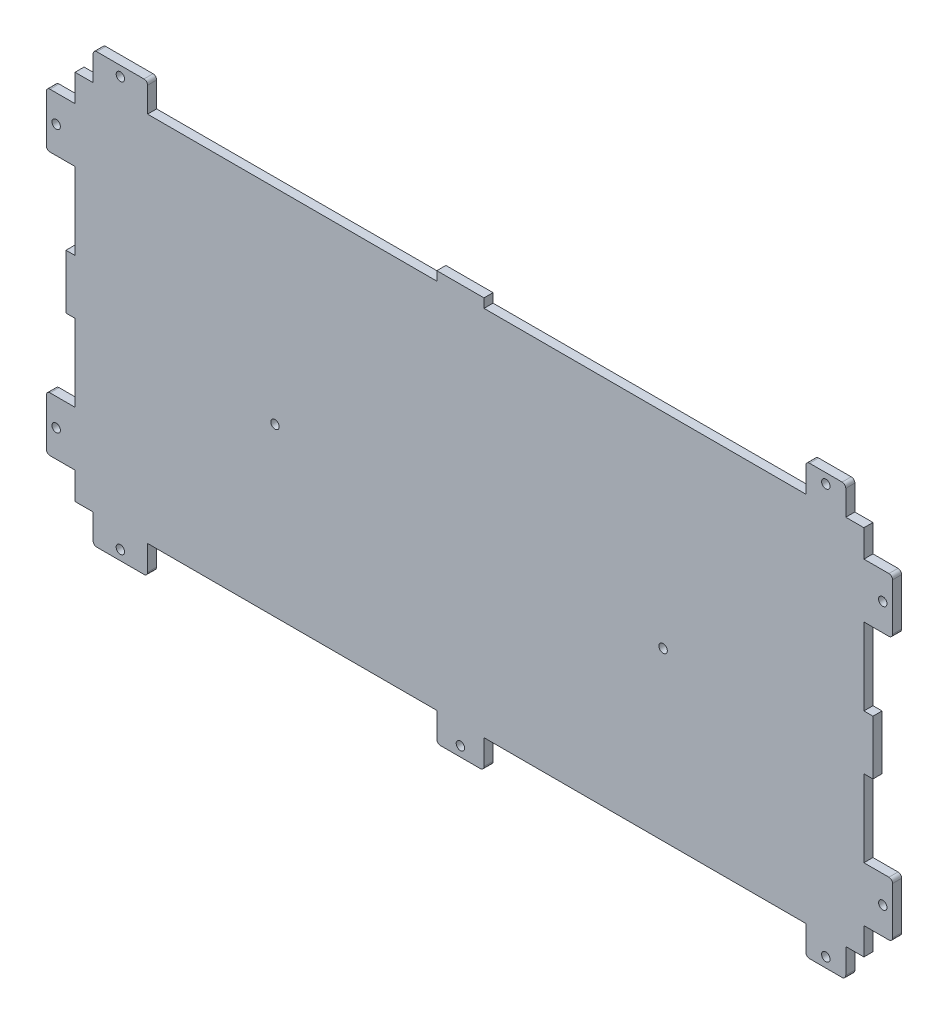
ISO-10303-21;
HEADER;
FILE_DESCRIPTION(('STEP AP214'),'2;1');
FILE_NAME('part.step','',(''),(''),'','','');
FILE_SCHEMA(('AUTOMOTIVE_DESIGN { 1 0 10303 214 1 1 1 1 }'));
ENDSEC;
DATA;
#1=APPLICATION_CONTEXT('core data for automotive mechanical design processes');
#2=APPLICATION_PROTOCOL_DEFINITION('international standard','automotive_design',2000,#1);
#3=PRODUCT_CONTEXT('',#1,'mechanical');
#4=PRODUCT('Part','Part','',(#3));
#5=PRODUCT_RELATED_PRODUCT_CATEGORY('part','',(#4));
#6=PRODUCT_DEFINITION_FORMATION('','',#4);
#7=PRODUCT_DEFINITION_CONTEXT('part definition',#1,'design');
#8=PRODUCT_DEFINITION('design','',#6,#7);
#9=PRODUCT_DEFINITION_SHAPE('','',#8);
#10=(LENGTH_UNIT() NAMED_UNIT(*) SI_UNIT(.MILLI.,.METRE.));
#11=(NAMED_UNIT(*) PLANE_ANGLE_UNIT() SI_UNIT($,.RADIAN.));
#12=(NAMED_UNIT(*) SI_UNIT($,.STERADIAN.) SOLID_ANGLE_UNIT());
#13=UNCERTAINTY_MEASURE_WITH_UNIT(LENGTH_MEASURE(1.E-05),#10,'distance_accuracy_value','');
#14=(GEOMETRIC_REPRESENTATION_CONTEXT(3) GLOBAL_UNCERTAINTY_ASSIGNED_CONTEXT((#13)) GLOBAL_UNIT_ASSIGNED_CONTEXT((#10,
#11,#12)) REPRESENTATION_CONTEXT('',''));
#15=CARTESIAN_POINT('',(0.,0.,0.));
#16=DIRECTION('',(0.,0.,1.));
#17=DIRECTION('',(1.,0.,0.));
#18=AXIS2_PLACEMENT_3D('',#15,#16,#17);
#19=CARTESIAN_POINT('',(0.,0.,3.175));
#20=DIRECTION('',(0.,0.,-1.));
#21=DIRECTION('',(-1.,0.,0.));
#22=AXIS2_PLACEMENT_3D('',#19,#20,#21);
#23=PLANE('',#22);
#24=CARTESIAN_POINT('',(70.0139248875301,58.42,3.175));
#25=DIRECTION('',(0.,0.,1.));
#26=DIRECTION('',(1.,0.,0.));
#27=AXIS2_PLACEMENT_3D('',#24,#25,#26);
#28=CIRCLE('',#27,1.47319999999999);
#29=CARTESIAN_POINT('',(71.4871248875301,58.42,3.175));
#30=VERTEX_POINT('',#29);
#31=EDGE_CURVE('E1567',#30,#30,#28,.T.);
#32=ORIENTED_EDGE('',*,*,#31,.F.);
#33=EDGE_LOOP('',(#32));
#34=FACE_BOUND('',#33,.T.);
#35=CARTESIAN_POINT('',(15.875,-6.604,3.175));
#36=DIRECTION('',(0.,0.,1.));
#37=DIRECTION('',(1.,0.,0.));
#38=AXIS2_PLACEMENT_3D('',#35,#36,#37);
#39=CIRCLE('',#38,1.47319999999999);
#40=CARTESIAN_POINT('',(17.3482,-6.604,3.175));
#41=VERTEX_POINT('',#40);
#42=EDGE_CURVE('E1076',#41,#41,#39,.T.);
#43=ORIENTED_EDGE('',*,*,#42,.F.);
#44=EDGE_LOOP('',(#43));
#45=FACE_BOUND('',#44,.T.);
#46=CARTESIAN_POINT('',(282.829,111.125,3.175));
#47=DIRECTION('',(0.,0.,1.));
#48=DIRECTION('',(1.,0.,0.));
#49=AXIS2_PLACEMENT_3D('',#46,#47,#48);
#50=CIRCLE('',#49,1.47320000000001);
#51=CARTESIAN_POINT('',(284.3022,111.125,3.175));
#52=VERTEX_POINT('',#51);
#53=EDGE_CURVE('E1539',#52,#52,#50,.T.);
#54=ORIENTED_EDGE('',*,*,#53,.F.);
#55=EDGE_LOOP('',(#54));
#56=FACE_BOUND('',#55,.T.);
#57=CARTESIAN_POINT('',(282.829,19.05,3.175));
#58=DIRECTION('',(0.,0.,1.));
#59=DIRECTION('',(1.,0.,0.));
#60=AXIS2_PLACEMENT_3D('',#57,#58,#59);
#61=CIRCLE('',#60,1.47320000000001);
#62=CARTESIAN_POINT('',(284.3022,19.05,3.175));
#63=VERTEX_POINT('',#62);
#64=EDGE_CURVE('E1533',#63,#63,#61,.T.);
#65=ORIENTED_EDGE('',*,*,#64,.F.);
#66=EDGE_LOOP('',(#65));
#67=FACE_BOUND('',#66,.T.);
#68=CARTESIAN_POINT('',(-6.60400000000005,111.125,3.175));
#69=DIRECTION('',(0.,0.,1.));
#70=DIRECTION('',(1.,0.,0.));
#71=AXIS2_PLACEMENT_3D('',#68,#69,#70);
#72=CIRCLE('',#71,1.47319999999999);
#73=CARTESIAN_POINT('',(-5.13080000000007,111.125,3.175));
#74=VERTEX_POINT('',#73);
#75=EDGE_CURVE('E1527',#74,#74,#72,.T.);
#76=ORIENTED_EDGE('',*,*,#75,.F.);
#77=EDGE_LOOP('',(#76));
#78=FACE_BOUND('',#77,.T.);
#79=CARTESIAN_POINT('',(-6.604,19.05,3.175));
#80=DIRECTION('',(0.,0.,1.));
#81=DIRECTION('',(1.,0.,0.));
#82=AXIS2_PLACEMENT_3D('',#79,#80,#81);
#83=CIRCLE('',#82,1.47319999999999);
#84=CARTESIAN_POINT('',(-5.13080000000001,19.05,3.175));
#85=VERTEX_POINT('',#84);
#86=EDGE_CURVE('E1083',#85,#85,#83,.T.);
#87=ORIENTED_EDGE('',*,*,#86,.F.);
#88=EDGE_LOOP('',(#87));
#89=FACE_BOUND('',#88,.T.);
#90=DIRECTION('',(-1.,0.,0.));
#91=VECTOR('',#90,1.);
#92=CARTESIAN_POINT('',(0.,120.65,3.175));
#93=LINE('',#92,#91);
#94=CARTESIAN_POINT('',(0.,120.65,3.175));
#95=VERTEX_POINT('',#94);
#96=CARTESIAN_POINT('',(-8.76300000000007,120.65,3.175));
#97=VERTEX_POINT('',#96);
#98=EDGE_CURVE('E927',#95,#97,#93,.T.);
#99=ORIENTED_EDGE('',*,*,#98,.T.);
#100=CARTESIAN_POINT('',(-8.76300000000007,119.38,3.175));
#101=DIRECTION('',(0.,0.,-1.));
#102=DIRECTION('',(-1.,0.,0.));
#103=AXIS2_PLACEMENT_3D('',#100,#101,#102);
#104=CIRCLE('',#103,1.27);
#105=CARTESIAN_POINT('',(-10.0330000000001,119.38,3.175));
#106=VERTEX_POINT('',#105);
#107=EDGE_CURVE('E792',#97,#106,#104,.F.);
#108=ORIENTED_EDGE('',*,*,#107,.T.);
#109=DIRECTION('',(0.,-1.,0.));
#110=VECTOR('',#109,1.);
#111=CARTESIAN_POINT('',(-10.0330000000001,120.65,3.175));
#112=LINE('',#111,#110);
#113=CARTESIAN_POINT('',(-10.0330000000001,102.87,3.175));
#114=VERTEX_POINT('',#113);
#115=EDGE_CURVE('E929',#106,#114,#112,.T.);
#116=ORIENTED_EDGE('',*,*,#115,.T.);
#117=CARTESIAN_POINT('',(-8.76300000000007,102.87,3.175));
#118=DIRECTION('',(0.,0.,-1.));
#119=DIRECTION('',(-1.,0.,0.));
#120=AXIS2_PLACEMENT_3D('',#117,#118,#119);
#121=CIRCLE('',#120,1.27);
#122=CARTESIAN_POINT('',(-8.76300000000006,101.6,3.175));
#123=VERTEX_POINT('',#122);
#124=EDGE_CURVE('E788',#114,#123,#121,.F.);
#125=ORIENTED_EDGE('',*,*,#124,.T.);
#126=DIRECTION('',(1.,0.,0.));
#127=VECTOR('',#126,1.);
#128=CARTESIAN_POINT('',(0.,101.6,3.175));
#129=LINE('',#128,#127);
#130=CARTESIAN_POINT('',(0.,101.6,3.175));
#131=VERTEX_POINT('',#130);
#132=EDGE_CURVE('E933',#123,#131,#129,.T.);
#133=ORIENTED_EDGE('',*,*,#132,.T.);
#134=DIRECTION('',(0.,-1.,0.));
#135=VECTOR('',#134,1.);
#136=CARTESIAN_POINT('',(0.,0.,3.175));
#137=LINE('',#136,#135);
#138=CARTESIAN_POINT('',(0.,74.6125,3.175));
#139=VERTEX_POINT('',#138);
#140=EDGE_CURVE('E625',#131,#139,#137,.T.);
#141=ORIENTED_EDGE('',*,*,#140,.T.);
#142=DIRECTION('',(-1.,0.,0.));
#143=VECTOR('',#142,1.);
#144=CARTESIAN_POINT('',(0.,74.6125,3.175));
#145=LINE('',#144,#143);
#146=CARTESIAN_POINT('',(-3.1750000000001,74.6125,3.175));
#147=VERTEX_POINT('',#146);
#148=EDGE_CURVE('E949',#139,#147,#145,.T.);
#149=ORIENTED_EDGE('',*,*,#148,.T.);
#150=DIRECTION('',(0.,-1.,0.));
#151=VECTOR('',#150,1.);
#152=CARTESIAN_POINT('',(-3.1750000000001,74.6125,3.175));
#153=LINE('',#152,#151);
#154=CARTESIAN_POINT('',(-3.17500000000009,55.5625,3.175));
#155=VERTEX_POINT('',#154);
#156=EDGE_CURVE('E952',#147,#155,#153,.T.);
#157=ORIENTED_EDGE('',*,*,#156,.T.);
#158=DIRECTION('',(1.,0.,0.));
#159=VECTOR('',#158,1.);
#160=CARTESIAN_POINT('',(0.,55.5625,3.175));
#161=LINE('',#160,#159);
#162=CARTESIAN_POINT('',(0.,55.5625,3.175));
#163=VERTEX_POINT('',#162);
#164=EDGE_CURVE('E955',#155,#163,#161,.T.);
#165=ORIENTED_EDGE('',*,*,#164,.T.);
#166=CARTESIAN_POINT('',(0.,28.575,3.175));
#167=VERTEX_POINT('',#166);
#168=EDGE_CURVE('E627',#163,#167,#137,.T.);
#169=ORIENTED_EDGE('',*,*,#168,.T.);
#170=DIRECTION('',(-1.,0.,0.));
#171=VECTOR('',#170,1.);
#172=CARTESIAN_POINT('',(0.,28.575,3.175));
#173=LINE('',#172,#171);
#174=CARTESIAN_POINT('',(-8.76300000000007,28.575,3.175));
#175=VERTEX_POINT('',#174);
#176=EDGE_CURVE('E977',#167,#175,#173,.T.);
#177=ORIENTED_EDGE('',*,*,#176,.T.);
#178=CARTESIAN_POINT('',(-8.76300000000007,27.305,3.175));
#179=DIRECTION('',(0.,0.,-1.));
#180=DIRECTION('',(-1.,0.,0.));
#181=AXIS2_PLACEMENT_3D('',#178,#179,#180);
#182=CIRCLE('',#181,1.27);
#183=CARTESIAN_POINT('',(-10.0330000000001,27.305,3.175));
#184=VERTEX_POINT('',#183);
#185=EDGE_CURVE('E790',#175,#184,#182,.F.);
#186=ORIENTED_EDGE('',*,*,#185,.T.);
#187=DIRECTION('',(0.,-1.,0.));
#188=VECTOR('',#187,1.);
#189=CARTESIAN_POINT('',(-10.033,9.525,3.175));
#190=LINE('',#189,#188);
#191=CARTESIAN_POINT('',(-10.033,10.795,3.175));
#192=VERTEX_POINT('',#191);
#193=EDGE_CURVE('E975',#184,#192,#190,.T.);
#194=ORIENTED_EDGE('',*,*,#193,.T.);
#195=CARTESIAN_POINT('',(-8.76300000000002,10.795,3.175));
#196=DIRECTION('',(0.,0.,-1.));
#197=DIRECTION('',(-1.,0.,0.));
#198=AXIS2_PLACEMENT_3D('',#195,#196,#197);
#199=CIRCLE('',#198,1.27);
#200=CARTESIAN_POINT('',(-8.76300000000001,9.525,3.175));
#201=VERTEX_POINT('',#200);
#202=EDGE_CURVE('E786',#192,#201,#199,.F.);
#203=ORIENTED_EDGE('',*,*,#202,.T.);
#204=DIRECTION('',(1.,0.,0.));
#205=VECTOR('',#204,1.);
#206=CARTESIAN_POINT('',(0.,9.52500000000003,3.175));
#207=LINE('',#206,#205);
#208=CARTESIAN_POINT('',(0.,9.52500000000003,3.175));
#209=VERTEX_POINT('',#208);
#210=EDGE_CURVE('E753',#201,#209,#207,.T.);
#211=ORIENTED_EDGE('',*,*,#210,.T.);
#212=CARTESIAN_POINT('',(0.,0.,3.175));
#213=VERTEX_POINT('',#212);
#214=EDGE_CURVE('E584',#209,#213,#137,.T.);
#215=ORIENTED_EDGE('',*,*,#214,.T.);
#216=DIRECTION('',(1.,0.,0.));
#217=VECTOR('',#216,1.);
#218=CARTESIAN_POINT('',(0.,0.,3.175));
#219=LINE('',#218,#217);
#220=CARTESIAN_POINT('',(6.35000000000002,0.,3.175));
#221=VERTEX_POINT('',#220);
#222=EDGE_CURVE('E605',#213,#221,#219,.T.);
#223=ORIENTED_EDGE('',*,*,#222,.T.);
#224=DIRECTION('',(0.,-1.,0.));
#225=VECTOR('',#224,1.);
#226=CARTESIAN_POINT('',(6.35000000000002,0.,3.175));
#227=LINE('',#226,#225);
#228=CARTESIAN_POINT('',(6.35000000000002,-8.76299999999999,3.175));
#229=VERTEX_POINT('',#228);
#230=EDGE_CURVE('E734',#221,#229,#227,.T.);
#231=ORIENTED_EDGE('',*,*,#230,.T.);
#232=CARTESIAN_POINT('',(7.62000000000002,-8.76299999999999,3.175));
#233=DIRECTION('',(0.,0.,-1.));
#234=DIRECTION('',(-1.,0.,0.));
#235=AXIS2_PLACEMENT_3D('',#232,#233,#234);
#236=CIRCLE('',#235,1.27);
#237=CARTESIAN_POINT('',(7.62000000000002,-10.033,3.175));
#238=VERTEX_POINT('',#237);
#239=EDGE_CURVE('E758',#229,#238,#236,.F.);
#240=ORIENTED_EDGE('',*,*,#239,.T.);
#241=DIRECTION('',(1.,0.,0.));
#242=VECTOR('',#241,1.);
#243=CARTESIAN_POINT('',(6.35000000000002,-10.033,3.175));
#244=LINE('',#243,#242);
#245=CARTESIAN_POINT('',(24.13,-10.033,3.175));
#246=VERTEX_POINT('',#245);
#247=EDGE_CURVE('E752',#238,#246,#244,.T.);
#248=ORIENTED_EDGE('',*,*,#247,.T.);
#249=CARTESIAN_POINT('',(24.13,-8.76299999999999,3.175));
#250=DIRECTION('',(0.,0.,-1.));
#251=DIRECTION('',(-1.,0.,0.));
#252=AXIS2_PLACEMENT_3D('',#249,#250,#251);
#253=CIRCLE('',#252,1.27);
#254=CARTESIAN_POINT('',(25.4,-8.76299999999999,3.175));
#255=VERTEX_POINT('',#254);
#256=EDGE_CURVE('E760',#246,#255,#253,.F.);
#257=ORIENTED_EDGE('',*,*,#256,.T.);
#258=DIRECTION('',(0.,1.,0.));
#259=VECTOR('',#258,1.);
#260=CARTESIAN_POINT('',(25.4,0.,3.175));
#261=LINE('',#260,#259);
#262=CARTESIAN_POINT('',(25.4,0.,3.175));
#263=VERTEX_POINT('',#262);
#264=EDGE_CURVE('E749',#255,#263,#261,.T.);
#265=ORIENTED_EDGE('',*,*,#264,.T.);
#266=CARTESIAN_POINT('',(126.6825,0.,3.175));
#267=VERTEX_POINT('',#266);
#268=EDGE_CURVE('E601',#263,#267,#219,.T.);
#269=ORIENTED_EDGE('',*,*,#268,.T.);
#270=DIRECTION('',(0.,-1.,0.));
#271=VECTOR('',#270,1.);
#272=CARTESIAN_POINT('',(126.6825,0.,3.175));
#273=LINE('',#272,#271);
#274=CARTESIAN_POINT('',(126.6825,-8.763,3.175));
#275=VERTEX_POINT('',#274);
#276=EDGE_CURVE('E911',#267,#275,#273,.T.);
#277=ORIENTED_EDGE('',*,*,#276,.T.);
#278=CARTESIAN_POINT('',(127.9525,-8.763,3.175));
#279=DIRECTION('',(0.,0.,-1.));
#280=DIRECTION('',(-1.,0.,0.));
#281=AXIS2_PLACEMENT_3D('',#278,#279,#280);
#282=CIRCLE('',#281,1.27);
#283=CARTESIAN_POINT('',(127.9525,-10.033,3.175));
#284=VERTEX_POINT('',#283);
#285=EDGE_CURVE('E763',#275,#284,#282,.F.);
#286=ORIENTED_EDGE('',*,*,#285,.T.);
#287=DIRECTION('',(1.,0.,0.));
#288=VECTOR('',#287,1.);
#289=CARTESIAN_POINT('',(126.6825,-10.033,3.175));
#290=LINE('',#289,#288);
#291=CARTESIAN_POINT('',(141.9225,-10.033,3.175));
#292=VERTEX_POINT('',#291);
#293=EDGE_CURVE('E918',#284,#292,#290,.T.);
#294=ORIENTED_EDGE('',*,*,#293,.T.);
#295=CARTESIAN_POINT('',(141.9225,-8.763,3.175));
#296=DIRECTION('',(0.,0.,-1.));
#297=DIRECTION('',(-1.,0.,0.));
#298=AXIS2_PLACEMENT_3D('',#295,#296,#297);
#299=CIRCLE('',#298,1.27);
#300=CARTESIAN_POINT('',(143.1925,-8.763,3.175));
#301=VERTEX_POINT('',#300);
#302=EDGE_CURVE('E765',#292,#301,#299,.F.);
#303=ORIENTED_EDGE('',*,*,#302,.T.);
#304=DIRECTION('',(0.,1.,0.));
#305=VECTOR('',#304,1.);
#306=CARTESIAN_POINT('',(143.1925,0.,3.175));
#307=LINE('',#306,#305);
#308=CARTESIAN_POINT('',(143.1925,0.,3.175));
#309=VERTEX_POINT('',#308);
#310=EDGE_CURVE('E913',#301,#309,#307,.T.);
#311=ORIENTED_EDGE('',*,*,#310,.T.);
#312=CARTESIAN_POINT('',(255.905,0.,3.175));
#313=VERTEX_POINT('',#312);
#314=EDGE_CURVE('E588',#309,#313,#219,.T.);
#315=ORIENTED_EDGE('',*,*,#314,.T.);
#316=DIRECTION('',(0.,-1.,0.));
#317=VECTOR('',#316,1.);
#318=CARTESIAN_POINT('',(255.905,0.,3.175));
#319=LINE('',#318,#317);
#320=CARTESIAN_POINT('',(255.905,-8.763,3.175));
#321=VERTEX_POINT('',#320);
#322=EDGE_CURVE('E1311',#313,#321,#319,.T.);
#323=ORIENTED_EDGE('',*,*,#322,.T.);
#324=CARTESIAN_POINT('',(257.175,-8.763,3.175));
#325=DIRECTION('',(0.,0.,-1.));
#326=DIRECTION('',(-1.,0.,0.));
#327=AXIS2_PLACEMENT_3D('',#324,#325,#326);
#328=CIRCLE('',#327,1.27);
#329=CARTESIAN_POINT('',(257.175,-10.033,3.175));
#330=VERTEX_POINT('',#329);
#331=EDGE_CURVE('E767',#321,#330,#328,.F.);
#332=ORIENTED_EDGE('',*,*,#331,.T.);
#333=DIRECTION('',(1.,0.,0.));
#334=VECTOR('',#333,1.);
#335=CARTESIAN_POINT('',(255.905,-10.033,3.175));
#336=LINE('',#335,#334);
#337=CARTESIAN_POINT('',(268.605,-10.033,3.175));
#338=VERTEX_POINT('',#337);
#339=EDGE_CURVE('E1316',#330,#338,#336,.T.);
#340=ORIENTED_EDGE('',*,*,#339,.T.);
#341=CARTESIAN_POINT('',(268.605,-8.76299999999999,3.175));
#342=DIRECTION('',(0.,0.,-1.));
#343=DIRECTION('',(-1.,0.,0.));
#344=AXIS2_PLACEMENT_3D('',#341,#342,#343);
#345=CIRCLE('',#344,1.27);
#346=CARTESIAN_POINT('',(269.875,-8.76299999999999,3.175));
#347=VERTEX_POINT('',#346);
#348=EDGE_CURVE('E769',#338,#347,#345,.F.);
#349=ORIENTED_EDGE('',*,*,#348,.T.);
#350=DIRECTION('',(0.,1.,0.));
#351=VECTOR('',#350,1.);
#352=CARTESIAN_POINT('',(269.875,0.,3.175));
#353=LINE('',#352,#351);
#354=CARTESIAN_POINT('',(269.875,0.,3.175));
#355=VERTEX_POINT('',#354);
#356=EDGE_CURVE('E1319',#347,#355,#353,.T.);
#357=ORIENTED_EDGE('',*,*,#356,.T.);
#358=CARTESIAN_POINT('',(276.225,0.,3.175));
#359=VERTEX_POINT('',#358);
#360=EDGE_CURVE('E585',#355,#359,#219,.T.);
#361=ORIENTED_EDGE('',*,*,#360,.T.);
#362=DIRECTION('',(0.,1.,0.));
#363=VECTOR('',#362,1.);
#364=CARTESIAN_POINT('',(276.225,0.,3.175));
#365=LINE('',#364,#363);
#366=CARTESIAN_POINT('',(276.225,9.52500000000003,3.175));
#367=VERTEX_POINT('',#366);
#368=EDGE_CURVE('E1000',#359,#367,#365,.T.);
#369=ORIENTED_EDGE('',*,*,#368,.T.);
#370=DIRECTION('',(1.,0.,0.));
#371=VECTOR('',#370,1.);
#372=CARTESIAN_POINT('',(276.225,9.52500000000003,3.175));
#373=LINE('',#372,#371);
#374=CARTESIAN_POINT('',(284.988,9.52500000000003,3.175));
#375=VERTEX_POINT('',#374);
#376=EDGE_CURVE('E655',#367,#375,#373,.T.);
#377=ORIENTED_EDGE('',*,*,#376,.T.);
#378=CARTESIAN_POINT('',(284.988,10.795,3.175));
#379=DIRECTION('',(0.,0.,-1.));
#380=DIRECTION('',(-1.,0.,0.));
#381=AXIS2_PLACEMENT_3D('',#378,#379,#380);
#382=CIRCLE('',#381,1.27);
#383=CARTESIAN_POINT('',(286.258,10.795,3.175));
#384=VERTEX_POINT('',#383);
#385=EDGE_CURVE('E778',#375,#384,#382,.F.);
#386=ORIENTED_EDGE('',*,*,#385,.T.);
#387=DIRECTION('',(0.,1.,0.));
#388=VECTOR('',#387,1.);
#389=CARTESIAN_POINT('',(286.258,9.52500000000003,3.175));
#390=LINE('',#389,#388);
#391=CARTESIAN_POINT('',(286.258,27.305,3.175));
#392=VERTEX_POINT('',#391);
#393=EDGE_CURVE('E658',#384,#392,#390,.T.);
#394=ORIENTED_EDGE('',*,*,#393,.T.);
#395=CARTESIAN_POINT('',(284.988,27.305,3.175));
#396=DIRECTION('',(0.,0.,-1.));
#397=DIRECTION('',(-1.,0.,0.));
#398=AXIS2_PLACEMENT_3D('',#395,#396,#397);
#399=CIRCLE('',#398,1.27);
#400=CARTESIAN_POINT('',(284.988,28.575,3.175));
#401=VERTEX_POINT('',#400);
#402=EDGE_CURVE('E780',#392,#401,#399,.F.);
#403=ORIENTED_EDGE('',*,*,#402,.T.);
#404=DIRECTION('',(-1.,0.,0.));
#405=VECTOR('',#404,1.);
#406=CARTESIAN_POINT('',(276.225,28.575,3.175));
#407=LINE('',#406,#405);
#408=CARTESIAN_POINT('',(276.225,28.575,3.175));
#409=VERTEX_POINT('',#408);
#410=EDGE_CURVE('E662',#401,#409,#407,.T.);
#411=ORIENTED_EDGE('',*,*,#410,.T.);
#412=CARTESIAN_POINT('',(276.225,55.5625,3.175));
#413=VERTEX_POINT('',#412);
#414=EDGE_CURVE('E998',#409,#413,#365,.T.);
#415=ORIENTED_EDGE('',*,*,#414,.T.);
#416=DIRECTION('',(1.,0.,0.));
#417=VECTOR('',#416,1.);
#418=CARTESIAN_POINT('',(276.225,55.5625,3.175));
#419=LINE('',#418,#417);
#420=CARTESIAN_POINT('',(279.4,55.5625,3.175));
#421=VERTEX_POINT('',#420);
#422=EDGE_CURVE('E677',#413,#421,#419,.T.);
#423=ORIENTED_EDGE('',*,*,#422,.T.);
#424=DIRECTION('',(0.,1.,0.));
#425=VECTOR('',#424,1.);
#426=CARTESIAN_POINT('',(279.4,74.6125,3.175));
#427=LINE('',#426,#425);
#428=CARTESIAN_POINT('',(279.4,74.6125,3.175));
#429=VERTEX_POINT('',#428);
#430=EDGE_CURVE('E679',#421,#429,#427,.T.);
#431=ORIENTED_EDGE('',*,*,#430,.T.);
#432=DIRECTION('',(-1.,0.,0.));
#433=VECTOR('',#432,1.);
#434=CARTESIAN_POINT('',(276.225,74.6125,3.175));
#435=LINE('',#434,#433);
#436=CARTESIAN_POINT('',(276.225,74.6125,3.175));
#437=VERTEX_POINT('',#436);
#438=EDGE_CURVE('E682',#429,#437,#435,.T.);
#439=ORIENTED_EDGE('',*,*,#438,.T.);
#440=CARTESIAN_POINT('',(276.225,101.6,3.175));
#441=VERTEX_POINT('',#440);
#442=EDGE_CURVE('E1001',#437,#441,#365,.T.);
#443=ORIENTED_EDGE('',*,*,#442,.T.);
#444=DIRECTION('',(1.,0.,0.));
#445=VECTOR('',#444,1.);
#446=CARTESIAN_POINT('',(276.225,101.6,3.175));
#447=LINE('',#446,#445);
#448=CARTESIAN_POINT('',(284.988,101.6,3.175));
#449=VERTEX_POINT('',#448);
#450=EDGE_CURVE('E707',#441,#449,#447,.T.);
#451=ORIENTED_EDGE('',*,*,#450,.T.);
#452=CARTESIAN_POINT('',(284.988,102.87,3.175));
#453=DIRECTION('',(0.,0.,-1.));
#454=DIRECTION('',(-1.,0.,0.));
#455=AXIS2_PLACEMENT_3D('',#452,#453,#454);
#456=CIRCLE('',#455,1.27);
#457=CARTESIAN_POINT('',(286.258,102.87,3.175));
#458=VERTEX_POINT('',#457);
#459=EDGE_CURVE('E782',#449,#458,#456,.F.);
#460=ORIENTED_EDGE('',*,*,#459,.T.);
#461=DIRECTION('',(0.,1.,0.));
#462=VECTOR('',#461,1.);
#463=CARTESIAN_POINT('',(286.258,120.65,3.175));
#464=LINE('',#463,#462);
#465=CARTESIAN_POINT('',(286.258,119.38,3.175));
#466=VERTEX_POINT('',#465);
#467=EDGE_CURVE('E703',#458,#466,#464,.T.);
#468=ORIENTED_EDGE('',*,*,#467,.T.);
#469=CARTESIAN_POINT('',(284.988,119.38,3.175));
#470=DIRECTION('',(0.,0.,-1.));
#471=DIRECTION('',(-1.,0.,0.));
#472=AXIS2_PLACEMENT_3D('',#469,#470,#471);
#473=CIRCLE('',#472,1.27);
#474=CARTESIAN_POINT('',(284.988,120.65,3.175));
#475=VERTEX_POINT('',#474);
#476=EDGE_CURVE('E784',#466,#475,#473,.F.);
#477=ORIENTED_EDGE('',*,*,#476,.T.);
#478=DIRECTION('',(-1.,0.,0.));
#479=VECTOR('',#478,1.);
#480=CARTESIAN_POINT('',(276.225,120.65,3.175));
#481=LINE('',#480,#479);
#482=CARTESIAN_POINT('',(276.225,120.65,3.175));
#483=VERTEX_POINT('',#482);
#484=EDGE_CURVE('E706',#475,#483,#481,.T.);
#485=ORIENTED_EDGE('',*,*,#484,.T.);
#486=CARTESIAN_POINT('',(276.225,130.175,3.175));
#487=VERTEX_POINT('',#486);
#488=EDGE_CURVE('E720',#483,#487,#365,.T.);
#489=ORIENTED_EDGE('',*,*,#488,.T.);
#490=DIRECTION('',(-1.,0.,0.));
#491=VECTOR('',#490,1.);
#492=CARTESIAN_POINT('',(0.,130.175,3.175));
#493=LINE('',#492,#491);
#494=CARTESIAN_POINT('',(269.875,130.175,3.175));
#495=VERTEX_POINT('',#494);
#496=EDGE_CURVE('E1091',#487,#495,#493,.T.);
#497=ORIENTED_EDGE('',*,*,#496,.T.);
#498=DIRECTION('',(0.,1.,0.));
#499=VECTOR('',#498,1.);
#500=CARTESIAN_POINT('',(269.875,130.175,3.175));
#501=LINE('',#500,#499);
#502=CARTESIAN_POINT('',(269.875,138.938,3.175));
#503=VERTEX_POINT('',#502);
#504=EDGE_CURVE('E515',#495,#503,#501,.T.);
#505=ORIENTED_EDGE('',*,*,#504,.T.);
#506=CARTESIAN_POINT('',(268.605,138.938,3.175));
#507=DIRECTION('',(0.,0.,-1.));
#508=DIRECTION('',(-1.,0.,0.));
#509=AXIS2_PLACEMENT_3D('',#506,#507,#508);
#510=CIRCLE('',#509,1.27);
#511=CARTESIAN_POINT('',(268.605,140.208,3.175));
#512=VERTEX_POINT('',#511);
#513=EDGE_CURVE('E771',#503,#512,#510,.F.);
#514=ORIENTED_EDGE('',*,*,#513,.T.);
#515=DIRECTION('',(-1.,0.,0.));
#516=VECTOR('',#515,1.);
#517=CARTESIAN_POINT('',(255.905,140.208,3.175));
#518=LINE('',#517,#516);
#519=CARTESIAN_POINT('',(257.175,140.208,3.175));
#520=VERTEX_POINT('',#519);
#521=EDGE_CURVE('E519',#512,#520,#518,.T.);
#522=ORIENTED_EDGE('',*,*,#521,.T.);
#523=CARTESIAN_POINT('',(257.175,138.938,3.175));
#524=DIRECTION('',(0.,0.,-1.));
#525=DIRECTION('',(-1.,0.,0.));
#526=AXIS2_PLACEMENT_3D('',#523,#524,#525);
#527=CIRCLE('',#526,1.27);
#528=CARTESIAN_POINT('',(255.905,138.938,3.175));
#529=VERTEX_POINT('',#528);
#530=EDGE_CURVE('E773',#520,#529,#527,.F.);
#531=ORIENTED_EDGE('',*,*,#530,.T.);
#532=DIRECTION('',(0.,-1.,0.));
#533=VECTOR('',#532,1.);
#534=CARTESIAN_POINT('',(255.905,130.175,3.175));
#535=LINE('',#534,#533);
#536=CARTESIAN_POINT('',(255.905,130.175,3.175));
#537=VERTEX_POINT('',#536);
#538=EDGE_CURVE('E513',#529,#537,#535,.T.);
#539=ORIENTED_EDGE('',*,*,#538,.T.);
#540=CARTESIAN_POINT('',(143.1925,130.175,3.175));
#541=VERTEX_POINT('',#540);
#542=EDGE_CURVE('E479',#537,#541,#493,.T.);
#543=ORIENTED_EDGE('',*,*,#542,.T.);
#544=DIRECTION('',(0.,1.,0.));
#545=VECTOR('',#544,1.);
#546=CARTESIAN_POINT('',(143.1925,130.175,3.175));
#547=LINE('',#546,#545);
#548=CARTESIAN_POINT('',(143.1925,133.35,3.175));
#549=VERTEX_POINT('',#548);
#550=EDGE_CURVE('E470',#541,#549,#547,.T.);
#551=ORIENTED_EDGE('',*,*,#550,.T.);
#552=DIRECTION('',(-1.,0.,0.));
#553=VECTOR('',#552,1.);
#554=CARTESIAN_POINT('',(126.6825,133.35,3.175));
#555=LINE('',#554,#553);
#556=CARTESIAN_POINT('',(126.6825,133.35,3.175));
#557=VERTEX_POINT('',#556);
#558=EDGE_CURVE('E476',#549,#557,#555,.T.);
#559=ORIENTED_EDGE('',*,*,#558,.T.);
#560=DIRECTION('',(0.,-1.,0.));
#561=VECTOR('',#560,1.);
#562=CARTESIAN_POINT('',(126.6825,130.175,3.175));
#563=LINE('',#562,#561);
#564=CARTESIAN_POINT('',(126.6825,130.175,3.175));
#565=VERTEX_POINT('',#564);
#566=EDGE_CURVE('E482',#557,#565,#563,.T.);
#567=ORIENTED_EDGE('',*,*,#566,.T.);
#568=CARTESIAN_POINT('',(25.4,130.175,3.175));
#569=VERTEX_POINT('',#568);
#570=EDGE_CURVE('E1084',#565,#569,#493,.T.);
#571=ORIENTED_EDGE('',*,*,#570,.T.);
#572=DIRECTION('',(0.,1.,0.));
#573=VECTOR('',#572,1.);
#574=CARTESIAN_POINT('',(25.4,130.175,3.175));
#575=LINE('',#574,#573);
#576=CARTESIAN_POINT('',(25.4,138.938,3.175));
#577=VERTEX_POINT('',#576);
#578=EDGE_CURVE('E538',#569,#577,#575,.T.);
#579=ORIENTED_EDGE('',*,*,#578,.T.);
#580=CARTESIAN_POINT('',(24.13,138.938,3.175));
#581=DIRECTION('',(0.,0.,-1.));
#582=DIRECTION('',(-1.,0.,0.));
#583=AXIS2_PLACEMENT_3D('',#580,#581,#582);
#584=CIRCLE('',#583,1.27);
#585=CARTESIAN_POINT('',(24.13,140.208,3.175));
#586=VERTEX_POINT('',#585);
#587=EDGE_CURVE('E775',#577,#586,#584,.F.);
#588=ORIENTED_EDGE('',*,*,#587,.T.);
#589=DIRECTION('',(-1.,0.,0.));
#590=VECTOR('',#589,1.);
#591=CARTESIAN_POINT('',(6.35,140.208,3.175));
#592=LINE('',#591,#590);
#593=CARTESIAN_POINT('',(7.62,140.208,3.175));
#594=VERTEX_POINT('',#593);
#595=EDGE_CURVE('E535',#586,#594,#592,.T.);
#596=ORIENTED_EDGE('',*,*,#595,.T.);
#597=CARTESIAN_POINT('',(7.62,138.938,3.175));
#598=DIRECTION('',(0.,0.,-1.));
#599=DIRECTION('',(-1.,0.,0.));
#600=AXIS2_PLACEMENT_3D('',#597,#598,#599);
#601=CIRCLE('',#600,1.27);
#602=CARTESIAN_POINT('',(6.35,138.938,3.175));
#603=VERTEX_POINT('',#602);
#604=EDGE_CURVE('E48',#594,#603,#601,.F.);
#605=ORIENTED_EDGE('',*,*,#604,.T.);
#606=DIRECTION('',(0.,-1.,0.));
#607=VECTOR('',#606,1.);
#608=CARTESIAN_POINT('',(6.35000000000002,130.175,3.175));
#609=LINE('',#608,#607);
#610=CARTESIAN_POINT('',(6.35000000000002,130.175,3.175));
#611=VERTEX_POINT('',#610);
#612=EDGE_CURVE('E541',#603,#611,#609,.T.);
#613=ORIENTED_EDGE('',*,*,#612,.T.);
#614=CARTESIAN_POINT('',(0.,130.175,3.175));
#615=VERTEX_POINT('',#614);
#616=EDGE_CURVE('E1085',#611,#615,#493,.T.);
#617=ORIENTED_EDGE('',*,*,#616,.T.);
#618=EDGE_CURVE('E589',#615,#95,#137,.T.);
#619=ORIENTED_EDGE('',*,*,#618,.T.);
#620=EDGE_LOOP('',(#99,#108,#116,#125,#133,#141,#149,#157,#165,#169,#177,#186,#194,#203,#211,
#215,#223,#231,#240,#248,#257,#265,#269,#277,#286,#294,#303,#311,#315,#323,#332,#340,#349,#357,
#361,#369,#377,#386,#394,#403,#411,#415,#423,#431,#439,#443,#451,#460,#468,#477,#485,#489,#497,
#505,#514,#522,#531,#539,#543,#551,#559,#567,#571,#579,#588,#596,#605,#613,#617,#619));
#621=FACE_BOUND('',#620,.T.);
#622=CARTESIAN_POINT('',(15.875,136.779,3.175));
#623=DIRECTION('',(0.,0.,1.));
#624=DIRECTION('',(1.,0.,0.));
#625=AXIS2_PLACEMENT_3D('',#622,#623,#624);
#626=CIRCLE('',#625,1.47319999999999);
#627=CARTESIAN_POINT('',(17.3482,136.779,3.175));
#628=VERTEX_POINT('',#627);
#629=EDGE_CURVE('E1545',#628,#628,#626,.T.);
#630=ORIENTED_EDGE('',*,*,#629,.F.);
#631=EDGE_LOOP('',(#630));
#632=FACE_BOUND('',#631,.T.);
#633=CARTESIAN_POINT('',(262.89,136.779,3.175));
#634=DIRECTION('',(0.,0.,1.));
#635=DIRECTION('',(1.,0.,0.));
#636=AXIS2_PLACEMENT_3D('',#633,#634,#635);
#637=CIRCLE('',#636,1.47320000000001);
#638=CARTESIAN_POINT('',(264.3632,136.779,3.175));
#639=VERTEX_POINT('',#638);
#640=EDGE_CURVE('E1080',#639,#639,#637,.T.);
#641=ORIENTED_EDGE('',*,*,#640,.F.);
#642=EDGE_LOOP('',(#641));
#643=FACE_BOUND('',#642,.T.);
#644=CARTESIAN_POINT('',(262.89,-6.604,3.175));
#645=DIRECTION('',(0.,0.,1.));
#646=DIRECTION('',(1.,0.,0.));
#647=AXIS2_PLACEMENT_3D('',#644,#645,#646);
#648=CIRCLE('',#647,1.47320000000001);
#649=CARTESIAN_POINT('',(264.3632,-6.604,3.175));
#650=VERTEX_POINT('',#649);
#651=EDGE_CURVE('E1075',#650,#650,#648,.T.);
#652=ORIENTED_EDGE('',*,*,#651,.F.);
#653=EDGE_LOOP('',(#652));
#654=FACE_BOUND('',#653,.T.);
#655=CARTESIAN_POINT('',(134.9375,-6.604,3.175));
#656=DIRECTION('',(0.,0.,1.));
#657=DIRECTION('',(1.,0.,0.));
#658=AXIS2_PLACEMENT_3D('',#655,#656,#657);
#659=CIRCLE('',#658,1.47319999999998);
#660=CARTESIAN_POINT('',(136.4107,-6.604,3.175));
#661=VERTEX_POINT('',#660);
#662=EDGE_CURVE('E1070',#661,#661,#659,.T.);
#663=ORIENTED_EDGE('',*,*,#662,.F.);
#664=EDGE_LOOP('',(#663));
#665=FACE_BOUND('',#664,.T.);
#666=CARTESIAN_POINT('',(205.90392488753,58.42,3.175));
#667=DIRECTION('',(0.,0.,1.));
#668=DIRECTION('',(1.,0.,0.));
#669=AXIS2_PLACEMENT_3D('',#666,#667,#668);
#670=CIRCLE('',#669,1.47319999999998);
#671=CARTESIAN_POINT('',(207.37712488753,58.42,3.175));
#672=VERTEX_POINT('',#671);
#673=EDGE_CURVE('E1071',#672,#672,#670,.T.);
#674=ORIENTED_EDGE('',*,*,#673,.F.);
#675=EDGE_LOOP('',(#674));
#676=FACE_BOUND('',#675,.T.);
#677=ADVANCED_FACE('F33',(#34,#45,#56,#67,#78,#89,#621,#632,#643,#654,#665,#676),#23,.F.);
#678=CARTESIAN_POINT('',(0.,130.175,3.175));
#679=DIRECTION('',(0.,-1.,0.));
#680=DIRECTION('',(0.,0.,-1.));
#681=AXIS2_PLACEMENT_3D('',#678,#679,#680);
#682=PLANE('',#681);
#683=DIRECTION('',(0.,0.,-1.));
#684=VECTOR('',#683,1.);
#685=CARTESIAN_POINT('',(126.6825,130.175,3.175));
#686=LINE('',#685,#684);
#687=CARTESIAN_POINT('',(126.6825,130.175,0.));
#688=VERTEX_POINT('',#687);
#689=EDGE_CURVE('E509',#565,#688,#686,.T.);
#690=ORIENTED_EDGE('',*,*,#689,.T.);
#691=DIRECTION('',(-1.,0.,0.));
#692=VECTOR('',#691,1.);
#693=CARTESIAN_POINT('',(0.,130.175,0.));
#694=LINE('',#693,#692);
#695=CARTESIAN_POINT('',(25.4,130.175,0.));
#696=VERTEX_POINT('',#695);
#697=EDGE_CURVE('E566',#688,#696,#694,.T.);
#698=ORIENTED_EDGE('',*,*,#697,.T.);
#699=DIRECTION('',(0.,0.,-1.));
#700=VECTOR('',#699,1.);
#701=CARTESIAN_POINT('',(25.4,130.175,3.175));
#702=LINE('',#701,#700);
#703=EDGE_CURVE('E537',#569,#696,#702,.T.);
#704=ORIENTED_EDGE('',*,*,#703,.F.);
#705=ORIENTED_EDGE('',*,*,#570,.F.);
#706=EDGE_LOOP('',(#690,#698,#704,#705));
#707=FACE_BOUND('',#706,.T.);
#708=ADVANCED_FACE('F1194',(#707),#682,.F.);
#709=DIRECTION('',(0.,0.,-1.));
#710=VECTOR('',#709,1.);
#711=CARTESIAN_POINT('',(143.1925,130.175,3.175));
#712=LINE('',#711,#710);
#713=CARTESIAN_POINT('',(143.1925,130.175,0.));
#714=VERTEX_POINT('',#713);
#715=EDGE_CURVE('E491',#541,#714,#712,.T.);
#716=ORIENTED_EDGE('',*,*,#715,.F.);
#717=ORIENTED_EDGE('',*,*,#542,.F.);
#718=DIRECTION('',(0.,0.,-1.));
#719=VECTOR('',#718,1.);
#720=CARTESIAN_POINT('',(255.905,130.175,3.175));
#721=LINE('',#720,#719);
#722=CARTESIAN_POINT('',(255.905,130.175,0.));
#723=VERTEX_POINT('',#722);
#724=EDGE_CURVE('E531',#537,#723,#721,.T.);
#725=ORIENTED_EDGE('',*,*,#724,.T.);
#726=EDGE_CURVE('E562',#723,#714,#694,.T.);
#727=ORIENTED_EDGE('',*,*,#726,.T.);
#728=EDGE_LOOP('',(#716,#717,#725,#727));
#729=FACE_BOUND('',#728,.T.);
#730=ADVANCED_FACE('F1200',(#729),#682,.F.);
#731=DIRECTION('',(0.,0.,-1.));
#732=VECTOR('',#731,1.);
#733=CARTESIAN_POINT('',(269.875,130.175,3.175));
#734=LINE('',#733,#732);
#735=CARTESIAN_POINT('',(269.875,130.175,0.));
#736=VERTEX_POINT('',#735);
#737=EDGE_CURVE('E522',#495,#736,#734,.T.);
#738=ORIENTED_EDGE('',*,*,#737,.F.);
#739=ORIENTED_EDGE('',*,*,#496,.F.);
#740=DIRECTION('',(0.,0.,-1.));
#741=VECTOR('',#740,1.);
#742=CARTESIAN_POINT('',(276.225,130.175,3.175));
#743=LINE('',#742,#741);
#744=CARTESIAN_POINT('',(276.225,130.175,0.));
#745=VERTEX_POINT('',#744);
#746=EDGE_CURVE('E1096',#487,#745,#743,.T.);
#747=ORIENTED_EDGE('',*,*,#746,.T.);
#748=EDGE_CURVE('E565',#745,#736,#694,.T.);
#749=ORIENTED_EDGE('',*,*,#748,.T.);
#750=EDGE_LOOP('',(#738,#739,#747,#749));
#751=FACE_BOUND('',#750,.T.);
#752=ADVANCED_FACE('F1214',(#751),#682,.F.);
#753=CARTESIAN_POINT('',(0.,0.,3.175));
#754=DIRECTION('',(0.,1.,0.));
#755=DIRECTION('',(0.,0.,1.));
#756=AXIS2_PLACEMENT_3D('',#753,#754,#755);
#757=PLANE('',#756);
#758=DIRECTION('',(0.,0.,-1.));
#759=VECTOR('',#758,1.);
#760=CARTESIAN_POINT('',(255.905,0.,3.175));
#761=LINE('',#760,#759);
#762=CARTESIAN_POINT('',(255.905,0.,0.));
#763=VERTEX_POINT('',#762);
#764=EDGE_CURVE('E1308',#313,#763,#761,.T.);
#765=ORIENTED_EDGE('',*,*,#764,.F.);
#766=ORIENTED_EDGE('',*,*,#314,.F.);
#767=DIRECTION('',(0.,0.,-1.));
#768=VECTOR('',#767,1.);
#769=CARTESIAN_POINT('',(143.1925,0.,3.175));
#770=LINE('',#769,#768);
#771=CARTESIAN_POINT('',(143.1925,0.,0.));
#772=VERTEX_POINT('',#771);
#773=EDGE_CURVE('E912',#309,#772,#770,.T.);
#774=ORIENTED_EDGE('',*,*,#773,.T.);
#775=DIRECTION('',(1.,0.,0.));
#776=VECTOR('',#775,1.);
#777=CARTESIAN_POINT('',(0.,0.,0.));
#778=LINE('',#777,#776);
#779=EDGE_CURVE('E609',#772,#763,#778,.T.);
#780=ORIENTED_EDGE('',*,*,#779,.T.);
#781=EDGE_LOOP('',(#765,#766,#774,#780));
#782=FACE_BOUND('',#781,.T.);
#783=ADVANCED_FACE('F1223',(#782),#757,.F.);
#784=DIRECTION('',(0.,0.,-1.));
#785=VECTOR('',#784,1.);
#786=CARTESIAN_POINT('',(269.875,0.,3.175));
#787=LINE('',#786,#785);
#788=CARTESIAN_POINT('',(269.875,0.,0.));
#789=VERTEX_POINT('',#788);
#790=EDGE_CURVE('E1294',#355,#789,#787,.T.);
#791=ORIENTED_EDGE('',*,*,#790,.T.);
#792=CARTESIAN_POINT('',(276.225,0.,0.));
#793=VERTEX_POINT('',#792);
#794=EDGE_CURVE('E590',#789,#793,#778,.T.);
#795=ORIENTED_EDGE('',*,*,#794,.T.);
#796=DIRECTION('',(0.,0.,-1.));
#797=VECTOR('',#796,1.);
#798=CARTESIAN_POINT('',(276.225,0.,3.175));
#799=LINE('',#798,#797);
#800=EDGE_CURVE('E1101',#359,#793,#799,.T.);
#801=ORIENTED_EDGE('',*,*,#800,.F.);
#802=ORIENTED_EDGE('',*,*,#360,.F.);
#803=EDGE_LOOP('',(#791,#795,#801,#802));
#804=FACE_BOUND('',#803,.T.);
#805=ADVANCED_FACE('F1222',(#804),#757,.F.);
#806=DIRECTION('',(0.,0.,-1.));
#807=VECTOR('',#806,1.);
#808=CARTESIAN_POINT('',(126.6825,0.,3.175));
#809=LINE('',#808,#807);
#810=CARTESIAN_POINT('',(126.6825,0.,0.));
#811=VERTEX_POINT('',#810);
#812=EDGE_CURVE('E904',#267,#811,#809,.T.);
#813=ORIENTED_EDGE('',*,*,#812,.F.);
#814=ORIENTED_EDGE('',*,*,#268,.F.);
#815=DIRECTION('',(0.,0.,-1.));
#816=VECTOR('',#815,1.);
#817=CARTESIAN_POINT('',(25.4,0.,3.175));
#818=LINE('',#817,#816);
#819=CARTESIAN_POINT('',(25.4,0.,0.));
#820=VERTEX_POINT('',#819);
#821=EDGE_CURVE('E741',#263,#820,#818,.T.);
#822=ORIENTED_EDGE('',*,*,#821,.T.);
#823=EDGE_CURVE('E611',#820,#811,#778,.T.);
#824=ORIENTED_EDGE('',*,*,#823,.T.);
#825=EDGE_LOOP('',(#813,#814,#822,#824));
#826=FACE_BOUND('',#825,.T.);
#827=ADVANCED_FACE('F902',(#826),#757,.F.);
#828=DIRECTION('',(0.,0.,-1.));
#829=VECTOR('',#828,1.);
#830=CARTESIAN_POINT('',(6.35000000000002,0.,3.175));
#831=LINE('',#830,#829);
#832=CARTESIAN_POINT('',(6.35000000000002,0.,0.));
#833=VERTEX_POINT('',#832);
#834=EDGE_CURVE('E745',#221,#833,#831,.T.);
#835=ORIENTED_EDGE('',*,*,#834,.F.);
#836=ORIENTED_EDGE('',*,*,#222,.F.);
#837=DIRECTION('',(0.,0.,-1.));
#838=VECTOR('',#837,1.);
#839=CARTESIAN_POINT('',(0.,0.,3.175));
#840=LINE('',#839,#838);
#841=CARTESIAN_POINT('',(0.,0.,0.));
#842=VERTEX_POINT('',#841);
#843=EDGE_CURVE('E1064',#213,#842,#840,.T.);
#844=ORIENTED_EDGE('',*,*,#843,.T.);
#845=EDGE_CURVE('E621',#842,#833,#778,.T.);
#846=ORIENTED_EDGE('',*,*,#845,.T.);
#847=EDGE_LOOP('',(#835,#836,#844,#846));
#848=FACE_BOUND('',#847,.T.);
#849=ADVANCED_FACE('F1177',(#848),#757,.F.);
#850=CARTESIAN_POINT('',(0.,0.,3.175));
#851=DIRECTION('',(1.,0.,0.));
#852=DIRECTION('',(0.,0.,-1.));
#853=AXIS2_PLACEMENT_3D('',#850,#851,#852);
#854=PLANE('',#853);
#855=DIRECTION('',(0.,0.,-1.));
#856=VECTOR('',#855,1.);
#857=CARTESIAN_POINT('',(0.,120.65,3.175));
#858=LINE('',#857,#856);
#859=CARTESIAN_POINT('',(0.,120.65,0.));
#860=VERTEX_POINT('',#859);
#861=EDGE_CURVE('E935',#95,#860,#858,.T.);
#862=ORIENTED_EDGE('',*,*,#861,.F.);
#863=ORIENTED_EDGE('',*,*,#618,.F.);
#864=DIRECTION('',(0.,0.,-1.));
#865=VECTOR('',#864,1.);
#866=CARTESIAN_POINT('',(0.,130.175,3.175));
#867=LINE('',#866,#865);
#868=CARTESIAN_POINT('',(0.,130.175,0.));
#869=VERTEX_POINT('',#868);
#870=EDGE_CURVE('E574',#615,#869,#867,.T.);
#871=ORIENTED_EDGE('',*,*,#870,.T.);
#872=DIRECTION('',(0.,-1.,0.));
#873=VECTOR('',#872,1.);
#874=CARTESIAN_POINT('',(0.,0.,0.));
#875=LINE('',#874,#873);
#876=EDGE_CURVE('E630',#869,#860,#875,.T.);
#877=ORIENTED_EDGE('',*,*,#876,.T.);
#878=EDGE_LOOP('',(#862,#863,#871,#877));
#879=FACE_BOUND('',#878,.T.);
#880=ADVANCED_FACE('F1120',(#879),#854,.F.);
#881=DIRECTION('',(0.,0.,-1.));
#882=VECTOR('',#881,1.);
#883=CARTESIAN_POINT('',(0.,101.6,3.175));
#884=LINE('',#883,#882);
#885=CARTESIAN_POINT('',(0.,101.6,0.));
#886=VERTEX_POINT('',#885);
#887=EDGE_CURVE('E945',#131,#886,#884,.T.);
#888=ORIENTED_EDGE('',*,*,#887,.T.);
#889=CARTESIAN_POINT('',(0.,74.6125,0.));
#890=VERTEX_POINT('',#889);
#891=EDGE_CURVE('E628',#886,#890,#875,.T.);
#892=ORIENTED_EDGE('',*,*,#891,.T.);
#893=DIRECTION('',(0.,0.,-1.));
#894=VECTOR('',#893,1.);
#895=CARTESIAN_POINT('',(0.,74.6125,3.175));
#896=LINE('',#895,#894);
#897=EDGE_CURVE('E958',#139,#890,#896,.T.);
#898=ORIENTED_EDGE('',*,*,#897,.F.);
#899=ORIENTED_EDGE('',*,*,#140,.F.);
#900=EDGE_LOOP('',(#888,#892,#898,#899));
#901=FACE_BOUND('',#900,.T.);
#902=ADVANCED_FACE('F1135',(#901),#854,.F.);
#903=DIRECTION('',(0.,0.,-1.));
#904=VECTOR('',#903,1.);
#905=CARTESIAN_POINT('',(0.,55.5625,3.175));
#906=LINE('',#905,#904);
#907=CARTESIAN_POINT('',(0.,55.5625,0.));
#908=VERTEX_POINT('',#907);
#909=EDGE_CURVE('E967',#163,#908,#906,.T.);
#910=ORIENTED_EDGE('',*,*,#909,.T.);
#911=CARTESIAN_POINT('',(0.,28.575,0.));
#912=VERTEX_POINT('',#911);
#913=EDGE_CURVE('E631',#908,#912,#875,.T.);
#914=ORIENTED_EDGE('',*,*,#913,.T.);
#915=DIRECTION('',(0.,0.,-1.));
#916=VECTOR('',#915,1.);
#917=CARTESIAN_POINT('',(0.,28.575,3.175));
#918=LINE('',#917,#916);
#919=EDGE_CURVE('E642',#167,#912,#918,.T.);
#920=ORIENTED_EDGE('',*,*,#919,.F.);
#921=ORIENTED_EDGE('',*,*,#168,.F.);
#922=EDGE_LOOP('',(#910,#914,#920,#921));
#923=FACE_BOUND('',#922,.T.);
#924=ADVANCED_FACE('F1155',(#923),#854,.F.);
#925=CARTESIAN_POINT('',(276.225,0.,3.175));
#926=DIRECTION('',(-1.,0.,0.));
#927=DIRECTION('',(0.,0.,1.));
#928=AXIS2_PLACEMENT_3D('',#925,#926,#927);
#929=PLANE('',#928);
#930=DIRECTION('',(0.,0.,-1.));
#931=VECTOR('',#930,1.);
#932=CARTESIAN_POINT('',(276.225,9.52500000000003,3.175));
#933=LINE('',#932,#931);
#934=CARTESIAN_POINT('',(276.225,9.52500000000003,0.));
#935=VERTEX_POINT('',#934);
#936=EDGE_CURVE('E664',#367,#935,#933,.T.);
#937=ORIENTED_EDGE('',*,*,#936,.F.);
#938=ORIENTED_EDGE('',*,*,#368,.F.);
#939=ORIENTED_EDGE('',*,*,#800,.T.);
#940=DIRECTION('',(0.,1.,0.));
#941=VECTOR('',#940,1.);
#942=CARTESIAN_POINT('',(276.225,0.,0.));
#943=LINE('',#942,#941);
#944=EDGE_CURVE('E1004',#793,#935,#943,.T.);
#945=ORIENTED_EDGE('',*,*,#944,.T.);
#946=EDGE_LOOP('',(#937,#938,#939,#945));
#947=FACE_BOUND('',#946,.T.);
#948=ADVANCED_FACE('F1218',(#947),#929,.F.);
#949=DIRECTION('',(0.,0.,-1.));
#950=VECTOR('',#949,1.);
#951=CARTESIAN_POINT('',(276.225,28.575,3.175));
#952=LINE('',#951,#950);
#953=CARTESIAN_POINT('',(276.225,28.575,0.));
#954=VERTEX_POINT('',#953);
#955=EDGE_CURVE('E673',#409,#954,#952,.T.);
#956=ORIENTED_EDGE('',*,*,#955,.T.);
#957=CARTESIAN_POINT('',(276.225,55.5625,0.));
#958=VERTEX_POINT('',#957);
#959=EDGE_CURVE('E1002',#954,#958,#943,.T.);
#960=ORIENTED_EDGE('',*,*,#959,.T.);
#961=DIRECTION('',(0.,0.,-1.));
#962=VECTOR('',#961,1.);
#963=CARTESIAN_POINT('',(276.225,55.5625,3.175));
#964=LINE('',#963,#962);
#965=EDGE_CURVE('E699',#413,#958,#964,.T.);
#966=ORIENTED_EDGE('',*,*,#965,.F.);
#967=ORIENTED_EDGE('',*,*,#414,.F.);
#968=EDGE_LOOP('',(#956,#960,#966,#967));
#969=FACE_BOUND('',#968,.T.);
#970=ADVANCED_FACE('F1464',(#969),#929,.F.);
#971=DIRECTION('',(0.,0.,-1.));
#972=VECTOR('',#971,1.);
#973=CARTESIAN_POINT('',(276.225,74.6125,3.175));
#974=LINE('',#973,#972);
#975=CARTESIAN_POINT('',(276.225,74.6125,0.));
#976=VERTEX_POINT('',#975);
#977=EDGE_CURVE('E685',#437,#976,#974,.T.);
#978=ORIENTED_EDGE('',*,*,#977,.T.);
#979=CARTESIAN_POINT('',(276.225,101.6,0.));
#980=VERTEX_POINT('',#979);
#981=EDGE_CURVE('E1005',#976,#980,#943,.T.);
#982=ORIENTED_EDGE('',*,*,#981,.T.);
#983=DIRECTION('',(0.,0.,-1.));
#984=VECTOR('',#983,1.);
#985=CARTESIAN_POINT('',(276.225,101.6,3.175));
#986=LINE('',#985,#984);
#987=EDGE_CURVE('E719',#441,#980,#986,.T.);
#988=ORIENTED_EDGE('',*,*,#987,.F.);
#989=ORIENTED_EDGE('',*,*,#442,.F.);
#990=EDGE_LOOP('',(#978,#982,#988,#989));
#991=FACE_BOUND('',#990,.T.);
#992=ADVANCED_FACE('F1219',(#991),#929,.F.);
#993=ORIENTED_EDGE('',*,*,#214,.F.);
#994=DIRECTION('',(0.,0.,-1.));
#995=VECTOR('',#994,1.);
#996=CARTESIAN_POINT('',(0.,9.52500000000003,3.175));
#997=LINE('',#996,#995);
#998=CARTESIAN_POINT('',(0.,9.52500000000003,0.));
#999=VERTEX_POINT('',#998);
#1000=EDGE_CURVE('E647',#209,#999,#997,.T.);
#1001=ORIENTED_EDGE('',*,*,#1000,.T.);
#1002=EDGE_CURVE('E634',#999,#842,#875,.T.);
#1003=ORIENTED_EDGE('',*,*,#1002,.T.);
#1004=ORIENTED_EDGE('',*,*,#843,.F.);
#1005=EDGE_LOOP('',(#993,#1001,#1003,#1004));
#1006=FACE_BOUND('',#1005,.T.);
#1007=ADVANCED_FACE('F1172',(#1006),#854,.F.);
#1008=ORIENTED_EDGE('',*,*,#488,.F.);
#1009=DIRECTION('',(0.,0.,-1.));
#1010=VECTOR('',#1009,1.);
#1011=CARTESIAN_POINT('',(276.225,120.65,3.175));
#1012=LINE('',#1011,#1010);
#1013=CARTESIAN_POINT('',(276.225,120.65,0.));
#1014=VERTEX_POINT('',#1013);
#1015=EDGE_CURVE('E715',#483,#1014,#1012,.T.);
#1016=ORIENTED_EDGE('',*,*,#1015,.T.);
#1017=EDGE_CURVE('E624',#1014,#745,#943,.T.);
#1018=ORIENTED_EDGE('',*,*,#1017,.T.);
#1019=ORIENTED_EDGE('',*,*,#746,.F.);
#1020=EDGE_LOOP('',(#1008,#1016,#1018,#1019));
#1021=FACE_BOUND('',#1020,.T.);
#1022=ADVANCED_FACE('F1213',(#1021),#929,.F.);
#1023=ORIENTED_EDGE('',*,*,#616,.F.);
#1024=DIRECTION('',(0.,0.,-1.));
#1025=VECTOR('',#1024,1.);
#1026=CARTESIAN_POINT('',(6.35000000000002,130.175,3.175));
#1027=LINE('',#1026,#1025);
#1028=CARTESIAN_POINT('',(6.35000000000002,130.175,0.));
#1029=VERTEX_POINT('',#1028);
#1030=EDGE_CURVE('E551',#611,#1029,#1027,.T.);
#1031=ORIENTED_EDGE('',*,*,#1030,.T.);
#1032=EDGE_CURVE('E579',#1029,#869,#694,.T.);
#1033=ORIENTED_EDGE('',*,*,#1032,.T.);
#1034=ORIENTED_EDGE('',*,*,#870,.F.);
#1035=EDGE_LOOP('',(#1023,#1031,#1033,#1034));
#1036=FACE_BOUND('',#1035,.T.);
#1037=ADVANCED_FACE('F1118',(#1036),#682,.F.);
#1038=CARTESIAN_POINT('',(0.,0.,0.));
#1039=DIRECTION('',(0.,0.,-1.));
#1040=DIRECTION('',(-1.,0.,0.));
#1041=AXIS2_PLACEMENT_3D('',#1038,#1039,#1040);
#1042=PLANE('',#1041);
#1043=CARTESIAN_POINT('',(70.0139248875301,58.42,0.));
#1044=DIRECTION('',(0.,0.,-1.));
#1045=DIRECTION('',(-1.,0.,0.));
#1046=AXIS2_PLACEMENT_3D('',#1043,#1044,#1045);
#1047=CIRCLE('',#1046,1.47319999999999);
#1048=CARTESIAN_POINT('',(68.5407248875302,58.42,0.));
#1049=VERTEX_POINT('',#1048);
#1050=EDGE_CURVE('E1564',#1049,#1049,#1047,.T.);
#1051=ORIENTED_EDGE('',*,*,#1050,.F.);
#1052=EDGE_LOOP('',(#1051));
#1053=FACE_BOUND('',#1052,.T.);
#1054=CARTESIAN_POINT('',(205.90392488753,58.42,0.));
#1055=DIRECTION('',(0.,0.,-1.));
#1056=DIRECTION('',(-1.,0.,0.));
#1057=AXIS2_PLACEMENT_3D('',#1054,#1055,#1056);
#1058=CIRCLE('',#1057,1.47319999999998);
#1059=CARTESIAN_POINT('',(204.43072488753,58.42,0.));
#1060=VERTEX_POINT('',#1059);
#1061=EDGE_CURVE('E1067',#1060,#1060,#1058,.T.);
#1062=ORIENTED_EDGE('',*,*,#1061,.F.);
#1063=EDGE_LOOP('',(#1062));
#1064=FACE_BOUND('',#1063,.T.);
#1065=CARTESIAN_POINT('',(134.9375,-6.604,0.));
#1066=DIRECTION('',(0.,0.,-1.));
#1067=DIRECTION('',(-1.,0.,0.));
#1068=AXIS2_PLACEMENT_3D('',#1065,#1066,#1067);
#1069=CIRCLE('',#1068,1.47319999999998);
#1070=CARTESIAN_POINT('',(133.4643,-6.604,0.));
#1071=VERTEX_POINT('',#1070);
#1072=EDGE_CURVE('E1557',#1071,#1071,#1069,.T.);
#1073=ORIENTED_EDGE('',*,*,#1072,.F.);
#1074=EDGE_LOOP('',(#1073));
#1075=FACE_BOUND('',#1074,.T.);
#1076=CARTESIAN_POINT('',(15.875,-6.604,0.));
#1077=DIRECTION('',(0.,0.,-1.));
#1078=DIRECTION('',(-1.,0.,0.));
#1079=AXIS2_PLACEMENT_3D('',#1076,#1077,#1078);
#1080=CIRCLE('',#1079,1.47319999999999);
#1081=CARTESIAN_POINT('',(14.4018,-6.604,0.));
#1082=VERTEX_POINT('',#1081);
#1083=EDGE_CURVE('E1072',#1082,#1082,#1080,.T.);
#1084=ORIENTED_EDGE('',*,*,#1083,.F.);
#1085=EDGE_LOOP('',(#1084));
#1086=FACE_BOUND('',#1085,.T.);
#1087=CARTESIAN_POINT('',(262.89,-6.604,0.));
#1088=DIRECTION('',(0.,0.,-1.));
#1089=DIRECTION('',(-1.,0.,0.));
#1090=AXIS2_PLACEMENT_3D('',#1087,#1088,#1089);
#1091=CIRCLE('',#1090,1.47320000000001);
#1092=CARTESIAN_POINT('',(261.4168,-6.604,0.));
#1093=VERTEX_POINT('',#1092);
#1094=EDGE_CURVE('E1077',#1093,#1093,#1091,.T.);
#1095=ORIENTED_EDGE('',*,*,#1094,.F.);
#1096=EDGE_LOOP('',(#1095));
#1097=FACE_BOUND('',#1096,.T.);
#1098=CARTESIAN_POINT('',(262.89,136.779,0.));
#1099=DIRECTION('',(0.,0.,-1.));
#1100=DIRECTION('',(-1.,0.,0.));
#1101=AXIS2_PLACEMENT_3D('',#1098,#1099,#1100);
#1102=CIRCLE('',#1101,1.47320000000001);
#1103=CARTESIAN_POINT('',(261.4168,136.779,0.));
#1104=VERTEX_POINT('',#1103);
#1105=EDGE_CURVE('E1548',#1104,#1104,#1102,.T.);
#1106=ORIENTED_EDGE('',*,*,#1105,.F.);
#1107=EDGE_LOOP('',(#1106));
#1108=FACE_BOUND('',#1107,.T.);
#1109=CARTESIAN_POINT('',(15.875,136.779,0.));
#1110=DIRECTION('',(0.,0.,-1.));
#1111=DIRECTION('',(-1.,0.,0.));
#1112=AXIS2_PLACEMENT_3D('',#1109,#1110,#1111);
#1113=CIRCLE('',#1112,1.47319999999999);
#1114=CARTESIAN_POINT('',(14.4018,136.779,0.));
#1115=VERTEX_POINT('',#1114);
#1116=EDGE_CURVE('E1542',#1115,#1115,#1113,.T.);
#1117=ORIENTED_EDGE('',*,*,#1116,.F.);
#1118=EDGE_LOOP('',(#1117));
#1119=FACE_BOUND('',#1118,.T.);
#1120=CARTESIAN_POINT('',(282.829,111.125,0.));
#1121=DIRECTION('',(0.,0.,-1.));
#1122=DIRECTION('',(-1.,0.,0.));
#1123=AXIS2_PLACEMENT_3D('',#1120,#1121,#1122);
#1124=CIRCLE('',#1123,1.47320000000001);
#1125=CARTESIAN_POINT('',(281.3558,111.125,0.));
#1126=VERTEX_POINT('',#1125);
#1127=EDGE_CURVE('E1536',#1126,#1126,#1124,.T.);
#1128=ORIENTED_EDGE('',*,*,#1127,.F.);
#1129=EDGE_LOOP('',(#1128));
#1130=FACE_BOUND('',#1129,.T.);
#1131=CARTESIAN_POINT('',(282.829,19.05,0.));
#1132=DIRECTION('',(0.,0.,-1.));
#1133=DIRECTION('',(-1.,0.,0.));
#1134=AXIS2_PLACEMENT_3D('',#1131,#1132,#1133);
#1135=CIRCLE('',#1134,1.47320000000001);
#1136=CARTESIAN_POINT('',(281.3558,19.05,0.));
#1137=VERTEX_POINT('',#1136);
#1138=EDGE_CURVE('E1530',#1137,#1137,#1135,.T.);
#1139=ORIENTED_EDGE('',*,*,#1138,.F.);
#1140=EDGE_LOOP('',(#1139));
#1141=FACE_BOUND('',#1140,.T.);
#1142=CARTESIAN_POINT('',(-6.60400000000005,111.125,0.));
#1143=DIRECTION('',(0.,0.,-1.));
#1144=DIRECTION('',(-1.,0.,0.));
#1145=AXIS2_PLACEMENT_3D('',#1142,#1143,#1144);
#1146=CIRCLE('',#1145,1.47319999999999);
#1147=CARTESIAN_POINT('',(-8.07720000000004,111.125,0.));
#1148=VERTEX_POINT('',#1147);
#1149=EDGE_CURVE('E1524',#1148,#1148,#1146,.T.);
#1150=ORIENTED_EDGE('',*,*,#1149,.F.);
#1151=EDGE_LOOP('',(#1150));
#1152=FACE_BOUND('',#1151,.T.);
#1153=CARTESIAN_POINT('',(-6.604,19.05,0.));
#1154=DIRECTION('',(0.,0.,-1.));
#1155=DIRECTION('',(-1.,0.,0.));
#1156=AXIS2_PLACEMENT_3D('',#1153,#1154,#1155);
#1157=CIRCLE('',#1156,1.47319999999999);
#1158=CARTESIAN_POINT('',(-8.07719999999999,19.05,0.));
#1159=VERTEX_POINT('',#1158);
#1160=EDGE_CURVE('E504',#1159,#1159,#1157,.T.);
#1161=ORIENTED_EDGE('',*,*,#1160,.F.);
#1162=EDGE_LOOP('',(#1161));
#1163=FACE_BOUND('',#1162,.T.);
#1164=DIRECTION('',(0.,-1.,0.));
#1165=VECTOR('',#1164,1.);
#1166=CARTESIAN_POINT('',(-10.0330000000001,120.65,0.));
#1167=LINE('',#1166,#1165);
#1168=CARTESIAN_POINT('',(-10.0330000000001,119.38,0.));
#1169=VERTEX_POINT('',#1168);
#1170=CARTESIAN_POINT('',(-10.0330000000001,102.87,0.));
#1171=VERTEX_POINT('',#1170);
#1172=EDGE_CURVE('E939',#1169,#1171,#1167,.T.);
#1173=ORIENTED_EDGE('',*,*,#1172,.F.);
#1174=CARTESIAN_POINT('',(-8.76300000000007,119.38,0.));
#1175=DIRECTION('',(0.,0.,-1.));
#1176=DIRECTION('',(-1.,0.,0.));
#1177=AXIS2_PLACEMENT_3D('',#1174,#1175,#1176);
#1178=CIRCLE('',#1177,1.27);
#1179=CARTESIAN_POINT('',(-8.76300000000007,120.65,0.));
#1180=VERTEX_POINT('',#1179);
#1181=EDGE_CURVE('E1047',#1169,#1180,#1178,.T.);
#1182=ORIENTED_EDGE('',*,*,#1181,.T.);
#1183=DIRECTION('',(-1.,0.,0.));
#1184=VECTOR('',#1183,1.);
#1185=CARTESIAN_POINT('',(0.,120.65,0.));
#1186=LINE('',#1185,#1184);
#1187=EDGE_CURVE('E936',#860,#1180,#1186,.T.);
#1188=ORIENTED_EDGE('',*,*,#1187,.F.);
#1189=ORIENTED_EDGE('',*,*,#876,.F.);
#1190=ORIENTED_EDGE('',*,*,#1032,.F.);
#1191=DIRECTION('',(0.,-1.,0.));
#1192=VECTOR('',#1191,1.);
#1193=CARTESIAN_POINT('',(6.35000000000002,130.175,0.));
#1194=LINE('',#1193,#1192);
#1195=CARTESIAN_POINT('',(6.35,138.938,0.));
#1196=VERTEX_POINT('',#1195);
#1197=EDGE_CURVE('E534',#1196,#1029,#1194,.T.);
#1198=ORIENTED_EDGE('',*,*,#1197,.F.);
#1199=CARTESIAN_POINT('',(7.62,138.938,0.));
#1200=DIRECTION('',(0.,0.,-1.));
#1201=DIRECTION('',(-1.,0.,0.));
#1202=AXIS2_PLACEMENT_3D('',#1199,#1200,#1201);
#1203=CIRCLE('',#1202,1.27);
#1204=CARTESIAN_POINT('',(7.62,140.208,0.));
#1205=VERTEX_POINT('',#1204);
#1206=EDGE_CURVE('E1356',#1196,#1205,#1203,.T.);
#1207=ORIENTED_EDGE('',*,*,#1206,.T.);
#1208=DIRECTION('',(-1.,0.,0.));
#1209=VECTOR('',#1208,1.);
#1210=CARTESIAN_POINT('',(6.35,140.208,0.));
#1211=LINE('',#1210,#1209);
#1212=CARTESIAN_POINT('',(24.13,140.208,0.));
#1213=VERTEX_POINT('',#1212);
#1214=EDGE_CURVE('E539',#1213,#1205,#1211,.T.);
#1215=ORIENTED_EDGE('',*,*,#1214,.F.);
#1216=CARTESIAN_POINT('',(24.13,138.938,0.));
#1217=DIRECTION('',(0.,0.,-1.));
#1218=DIRECTION('',(-1.,0.,0.));
#1219=AXIS2_PLACEMENT_3D('',#1216,#1217,#1218);
#1220=CIRCLE('',#1219,1.27);
#1221=CARTESIAN_POINT('',(25.4,138.938,0.));
#1222=VERTEX_POINT('',#1221);
#1223=EDGE_CURVE('E1360',#1213,#1222,#1220,.T.);
#1224=ORIENTED_EDGE('',*,*,#1223,.T.);
#1225=DIRECTION('',(0.,1.,0.));
#1226=VECTOR('',#1225,1.);
#1227=CARTESIAN_POINT('',(25.4,130.175,0.));
#1228=LINE('',#1227,#1226);
#1229=EDGE_CURVE('E542',#696,#1222,#1228,.T.);
#1230=ORIENTED_EDGE('',*,*,#1229,.F.);
#1231=ORIENTED_EDGE('',*,*,#697,.F.);
#1232=DIRECTION('',(0.,-1.,0.));
#1233=VECTOR('',#1232,1.);
#1234=CARTESIAN_POINT('',(126.6825,130.175,0.));
#1235=LINE('',#1234,#1233);
#1236=CARTESIAN_POINT('',(126.6825,133.35,0.));
#1237=VERTEX_POINT('',#1236);
#1238=EDGE_CURVE('E501',#1237,#688,#1235,.T.);
#1239=ORIENTED_EDGE('',*,*,#1238,.F.);
#1240=DIRECTION('',(-1.,0.,0.));
#1241=VECTOR('',#1240,1.);
#1242=CARTESIAN_POINT('',(126.6825,133.35,0.));
#1243=LINE('',#1242,#1241);
#1244=CARTESIAN_POINT('',(143.1925,133.35,0.));
#1245=VERTEX_POINT('',#1244);
#1246=EDGE_CURVE('E506',#1245,#1237,#1243,.T.);
#1247=ORIENTED_EDGE('',*,*,#1246,.F.);
#1248=DIRECTION('',(0.,1.,0.));
#1249=VECTOR('',#1248,1.);
#1250=CARTESIAN_POINT('',(143.1925,130.175,0.));
#1251=LINE('',#1250,#1249);
#1252=EDGE_CURVE('E488',#714,#1245,#1251,.T.);
#1253=ORIENTED_EDGE('',*,*,#1252,.F.);
#1254=ORIENTED_EDGE('',*,*,#726,.F.);
#1255=DIRECTION('',(0.,-1.,0.));
#1256=VECTOR('',#1255,1.);
#1257=CARTESIAN_POINT('',(255.905,130.175,0.));
#1258=LINE('',#1257,#1256);
#1259=CARTESIAN_POINT('',(255.905,138.938,0.));
#1260=VERTEX_POINT('',#1259);
#1261=EDGE_CURVE('E512',#1260,#723,#1258,.T.);
#1262=ORIENTED_EDGE('',*,*,#1261,.F.);
#1263=CARTESIAN_POINT('',(257.175,138.938,0.));
#1264=DIRECTION('',(0.,0.,-1.));
#1265=DIRECTION('',(-1.,0.,0.));
#1266=AXIS2_PLACEMENT_3D('',#1263,#1264,#1265);
#1267=CIRCLE('',#1266,1.27);
#1268=CARTESIAN_POINT('',(257.175,140.208,0.));
#1269=VERTEX_POINT('',#1268);
#1270=EDGE_CURVE('E1362',#1260,#1269,#1267,.T.);
#1271=ORIENTED_EDGE('',*,*,#1270,.T.);
#1272=DIRECTION('',(-1.,0.,0.));
#1273=VECTOR('',#1272,1.);
#1274=CARTESIAN_POINT('',(255.905,140.208,0.));
#1275=LINE('',#1274,#1273);
#1276=CARTESIAN_POINT('',(268.605,140.208,0.));
#1277=VERTEX_POINT('',#1276);
#1278=EDGE_CURVE('E516',#1277,#1269,#1275,.T.);
#1279=ORIENTED_EDGE('',*,*,#1278,.F.);
#1280=CARTESIAN_POINT('',(268.605,138.938,0.));
#1281=DIRECTION('',(0.,0.,-1.));
#1282=DIRECTION('',(-1.,0.,0.));
#1283=AXIS2_PLACEMENT_3D('',#1280,#1281,#1282);
#1284=CIRCLE('',#1283,1.27);
#1285=CARTESIAN_POINT('',(269.875,138.938,0.));
#1286=VERTEX_POINT('',#1285);
#1287=EDGE_CURVE('E1364',#1277,#1286,#1284,.T.);
#1288=ORIENTED_EDGE('',*,*,#1287,.T.);
#1289=DIRECTION('',(0.,1.,0.));
#1290=VECTOR('',#1289,1.);
#1291=CARTESIAN_POINT('',(269.875,130.175,0.));
#1292=LINE('',#1291,#1290);
#1293=EDGE_CURVE('E524',#736,#1286,#1292,.T.);
#1294=ORIENTED_EDGE('',*,*,#1293,.F.);
#1295=ORIENTED_EDGE('',*,*,#748,.F.);
#1296=ORIENTED_EDGE('',*,*,#1017,.F.);
#1297=DIRECTION('',(-1.,0.,0.));
#1298=VECTOR('',#1297,1.);
#1299=CARTESIAN_POINT('',(276.225,120.65,0.));
#1300=LINE('',#1299,#1298);
#1301=CARTESIAN_POINT('',(284.988,120.65,0.));
#1302=VERTEX_POINT('',#1301);
#1303=EDGE_CURVE('E711',#1302,#1014,#1300,.T.);
#1304=ORIENTED_EDGE('',*,*,#1303,.F.);
#1305=CARTESIAN_POINT('',(284.988,119.38,0.));
#1306=DIRECTION('',(0.,0.,-1.));
#1307=DIRECTION('',(-1.,0.,0.));
#1308=AXIS2_PLACEMENT_3D('',#1305,#1306,#1307);
#1309=CIRCLE('',#1308,1.27);
#1310=CARTESIAN_POINT('',(286.258,119.38,0.));
#1311=VERTEX_POINT('',#1310);
#1312=EDGE_CURVE('E1032',#1302,#1311,#1309,.T.);
#1313=ORIENTED_EDGE('',*,*,#1312,.T.);
#1314=DIRECTION('',(0.,1.,0.));
#1315=VECTOR('',#1314,1.);
#1316=CARTESIAN_POINT('',(286.258,120.65,0.));
#1317=LINE('',#1316,#1315);
#1318=CARTESIAN_POINT('',(286.258,102.87,0.));
#1319=VERTEX_POINT('',#1318);
#1320=EDGE_CURVE('E708',#1319,#1311,#1317,.T.);
#1321=ORIENTED_EDGE('',*,*,#1320,.F.);
#1322=CARTESIAN_POINT('',(284.988,102.87,0.));
#1323=DIRECTION('',(0.,0.,-1.));
#1324=DIRECTION('',(-1.,0.,0.));
#1325=AXIS2_PLACEMENT_3D('',#1322,#1323,#1324);
#1326=CIRCLE('',#1325,1.27);
#1327=CARTESIAN_POINT('',(284.988,101.6,0.));
#1328=VERTEX_POINT('',#1327);
#1329=EDGE_CURVE('E1025',#1319,#1328,#1326,.T.);
#1330=ORIENTED_EDGE('',*,*,#1329,.T.);
#1331=DIRECTION('',(1.,0.,0.));
#1332=VECTOR('',#1331,1.);
#1333=CARTESIAN_POINT('',(276.225,101.6,0.));
#1334=LINE('',#1333,#1332);
#1335=EDGE_CURVE('E702',#980,#1328,#1334,.T.);
#1336=ORIENTED_EDGE('',*,*,#1335,.F.);
#1337=ORIENTED_EDGE('',*,*,#981,.F.);
#1338=DIRECTION('',(-1.,0.,0.));
#1339=VECTOR('',#1338,1.);
#1340=CARTESIAN_POINT('',(276.225,74.6125,0.));
#1341=LINE('',#1340,#1339);
#1342=CARTESIAN_POINT('',(279.4,74.6125,0.));
#1343=VERTEX_POINT('',#1342);
#1344=EDGE_CURVE('E680',#1343,#976,#1341,.T.);
#1345=ORIENTED_EDGE('',*,*,#1344,.F.);
#1346=DIRECTION('',(0.,1.,0.));
#1347=VECTOR('',#1346,1.);
#1348=CARTESIAN_POINT('',(279.4,74.6125,0.));
#1349=LINE('',#1348,#1347);
#1350=CARTESIAN_POINT('',(279.4,55.5625,0.));
#1351=VERTEX_POINT('',#1350);
#1352=EDGE_CURVE('E687',#1351,#1343,#1349,.T.);
#1353=ORIENTED_EDGE('',*,*,#1352,.F.);
#1354=DIRECTION('',(1.,0.,0.));
#1355=VECTOR('',#1354,1.);
#1356=CARTESIAN_POINT('',(276.225,55.5625,0.));
#1357=LINE('',#1356,#1355);
#1358=EDGE_CURVE('E676',#958,#1351,#1357,.T.);
#1359=ORIENTED_EDGE('',*,*,#1358,.F.);
#1360=ORIENTED_EDGE('',*,*,#959,.F.);
#1361=DIRECTION('',(-1.,0.,0.));
#1362=VECTOR('',#1361,1.);
#1363=CARTESIAN_POINT('',(276.225,28.575,0.));
#1364=LINE('',#1363,#1362);
#1365=CARTESIAN_POINT('',(284.988,28.575,0.));
#1366=VERTEX_POINT('',#1365);
#1367=EDGE_CURVE('E659',#1366,#954,#1364,.T.);
#1368=ORIENTED_EDGE('',*,*,#1367,.F.);
#1369=CARTESIAN_POINT('',(284.988,27.305,0.));
#1370=DIRECTION('',(0.,0.,-1.));
#1371=DIRECTION('',(-1.,0.,0.));
#1372=AXIS2_PLACEMENT_3D('',#1369,#1370,#1371);
#1373=CIRCLE('',#1372,1.27);
#1374=CARTESIAN_POINT('',(286.258,27.305,0.));
#1375=VERTEX_POINT('',#1374);
#1376=EDGE_CURVE('E1040',#1366,#1375,#1373,.T.);
#1377=ORIENTED_EDGE('',*,*,#1376,.T.);
#1378=DIRECTION('',(0.,1.,0.));
#1379=VECTOR('',#1378,1.);
#1380=CARTESIAN_POINT('',(286.258,9.52500000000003,0.));
#1381=LINE('',#1380,#1379);
#1382=CARTESIAN_POINT('',(286.258,10.795,0.));
#1383=VERTEX_POINT('',#1382);
#1384=EDGE_CURVE('E667',#1383,#1375,#1381,.T.);
#1385=ORIENTED_EDGE('',*,*,#1384,.F.);
#1386=CARTESIAN_POINT('',(284.988,10.795,0.));
#1387=DIRECTION('',(0.,0.,-1.));
#1388=DIRECTION('',(-1.,0.,0.));
#1389=AXIS2_PLACEMENT_3D('',#1386,#1387,#1388);
#1390=CIRCLE('',#1389,1.27);
#1391=CARTESIAN_POINT('',(284.988,9.52500000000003,0.));
#1392=VERTEX_POINT('',#1391);
#1393=EDGE_CURVE('E1348',#1383,#1392,#1390,.T.);
#1394=ORIENTED_EDGE('',*,*,#1393,.T.);
#1395=DIRECTION('',(1.,0.,0.));
#1396=VECTOR('',#1395,1.);
#1397=CARTESIAN_POINT('',(276.225,9.52500000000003,0.));
#1398=LINE('',#1397,#1396);
#1399=EDGE_CURVE('E646',#935,#1392,#1398,.T.);
#1400=ORIENTED_EDGE('',*,*,#1399,.F.);
#1401=ORIENTED_EDGE('',*,*,#944,.F.);
#1402=ORIENTED_EDGE('',*,*,#794,.F.);
#1403=DIRECTION('',(0.,1.,0.));
#1404=VECTOR('',#1403,1.);
#1405=CARTESIAN_POINT('',(269.875,0.,0.));
#1406=LINE('',#1405,#1404);
#1407=CARTESIAN_POINT('',(269.875,-8.76299999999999,0.));
#1408=VERTEX_POINT('',#1407);
#1409=EDGE_CURVE('E1317',#1408,#789,#1406,.T.);
#1410=ORIENTED_EDGE('',*,*,#1409,.F.);
#1411=CARTESIAN_POINT('',(268.605,-8.76299999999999,0.));
#1412=DIRECTION('',(0.,0.,-1.));
#1413=DIRECTION('',(-1.,0.,0.));
#1414=AXIS2_PLACEMENT_3D('',#1411,#1412,#1413);
#1415=CIRCLE('',#1414,1.27);
#1416=CARTESIAN_POINT('',(268.605,-10.033,0.));
#1417=VERTEX_POINT('',#1416);
#1418=EDGE_CURVE('E1366',#1408,#1417,#1415,.T.);
#1419=ORIENTED_EDGE('',*,*,#1418,.T.);
#1420=DIRECTION('',(1.,0.,0.));
#1421=VECTOR('',#1420,1.);
#1422=CARTESIAN_POINT('',(255.905,-10.033,0.));
#1423=LINE('',#1422,#1421);
#1424=CARTESIAN_POINT('',(257.175,-10.033,0.));
#1425=VERTEX_POINT('',#1424);
#1426=EDGE_CURVE('E1321',#1425,#1417,#1423,.T.);
#1427=ORIENTED_EDGE('',*,*,#1426,.F.);
#1428=CARTESIAN_POINT('',(257.175,-8.763,0.));
#1429=DIRECTION('',(0.,0.,-1.));
#1430=DIRECTION('',(-1.,0.,0.));
#1431=AXIS2_PLACEMENT_3D('',#1428,#1429,#1430);
#1432=CIRCLE('',#1431,1.27);
#1433=CARTESIAN_POINT('',(255.905,-8.763,0.));
#1434=VERTEX_POINT('',#1433);
#1435=EDGE_CURVE('E1368',#1425,#1434,#1432,.T.);
#1436=ORIENTED_EDGE('',*,*,#1435,.T.);
#1437=DIRECTION('',(0.,-1.,0.));
#1438=VECTOR('',#1437,1.);
#1439=CARTESIAN_POINT('',(255.905,0.,0.));
#1440=LINE('',#1439,#1438);
#1441=EDGE_CURVE('E1304',#763,#1434,#1440,.T.);
#1442=ORIENTED_EDGE('',*,*,#1441,.F.);
#1443=ORIENTED_EDGE('',*,*,#779,.F.);
#1444=DIRECTION('',(0.,1.,0.));
#1445=VECTOR('',#1444,1.);
#1446=CARTESIAN_POINT('',(143.1925,0.,0.));
#1447=LINE('',#1446,#1445);
#1448=CARTESIAN_POINT('',(143.1925,-8.763,0.));
#1449=VERTEX_POINT('',#1448);
#1450=EDGE_CURVE('E921',#1449,#772,#1447,.T.);
#1451=ORIENTED_EDGE('',*,*,#1450,.F.);
#1452=CARTESIAN_POINT('',(141.9225,-8.763,0.));
#1453=DIRECTION('',(0.,0.,-1.));
#1454=DIRECTION('',(-1.,0.,0.));
#1455=AXIS2_PLACEMENT_3D('',#1452,#1453,#1454);
#1456=CIRCLE('',#1455,1.27);
#1457=CARTESIAN_POINT('',(141.9225,-10.033,0.));
#1458=VERTEX_POINT('',#1457);
#1459=EDGE_CURVE('E1370',#1449,#1458,#1456,.T.);
#1460=ORIENTED_EDGE('',*,*,#1459,.T.);
#1461=DIRECTION('',(1.,0.,0.));
#1462=VECTOR('',#1461,1.);
#1463=CARTESIAN_POINT('',(126.6825,-10.033,0.));
#1464=LINE('',#1463,#1462);
#1465=CARTESIAN_POINT('',(127.9525,-10.033,0.));
#1466=VERTEX_POINT('',#1465);
#1467=EDGE_CURVE('E1293',#1466,#1458,#1464,.T.);
#1468=ORIENTED_EDGE('',*,*,#1467,.F.);
#1469=CARTESIAN_POINT('',(127.9525,-8.763,0.));
#1470=DIRECTION('',(0.,0.,-1.));
#1471=DIRECTION('',(-1.,0.,0.));
#1472=AXIS2_PLACEMENT_3D('',#1469,#1470,#1471);
#1473=CIRCLE('',#1472,1.27);
#1474=CARTESIAN_POINT('',(126.6825,-8.763,0.));
#1475=VERTEX_POINT('',#1474);
#1476=EDGE_CURVE('E1372',#1466,#1475,#1473,.T.);
#1477=ORIENTED_EDGE('',*,*,#1476,.T.);
#1478=DIRECTION('',(0.,-1.,0.));
#1479=VECTOR('',#1478,1.);
#1480=CARTESIAN_POINT('',(126.6825,0.,0.));
#1481=LINE('',#1480,#1479);
#1482=EDGE_CURVE('E899',#811,#1475,#1481,.T.);
#1483=ORIENTED_EDGE('',*,*,#1482,.F.);
#1484=ORIENTED_EDGE('',*,*,#823,.F.);
#1485=DIRECTION('',(0.,1.,0.));
#1486=VECTOR('',#1485,1.);
#1487=CARTESIAN_POINT('',(25.4,0.,0.));
#1488=LINE('',#1487,#1486);
#1489=CARTESIAN_POINT('',(25.4,-8.76299999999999,0.));
#1490=VERTEX_POINT('',#1489);
#1491=EDGE_CURVE('E731',#1490,#820,#1488,.T.);
#1492=ORIENTED_EDGE('',*,*,#1491,.F.);
#1493=CARTESIAN_POINT('',(24.13,-8.76299999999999,0.));
#1494=DIRECTION('',(0.,0.,-1.));
#1495=DIRECTION('',(-1.,0.,0.));
#1496=AXIS2_PLACEMENT_3D('',#1493,#1494,#1495);
#1497=CIRCLE('',#1496,1.27);
#1498=CARTESIAN_POINT('',(24.13,-10.033,0.));
#1499=VERTEX_POINT('',#1498);
#1500=EDGE_CURVE('E887',#1490,#1499,#1497,.T.);
#1501=ORIENTED_EDGE('',*,*,#1500,.T.);
#1502=DIRECTION('',(1.,0.,0.));
#1503=VECTOR('',#1502,1.);
#1504=CARTESIAN_POINT('',(6.35000000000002,-10.033,0.));
#1505=LINE('',#1504,#1503);
#1506=CARTESIAN_POINT('',(7.62000000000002,-10.033,0.));
#1507=VERTEX_POINT('',#1506);
#1508=EDGE_CURVE('E735',#1507,#1499,#1505,.T.);
#1509=ORIENTED_EDGE('',*,*,#1508,.F.);
#1510=CARTESIAN_POINT('',(7.62000000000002,-8.76299999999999,0.));
#1511=DIRECTION('',(0.,0.,-1.));
#1512=DIRECTION('',(-1.,0.,0.));
#1513=AXIS2_PLACEMENT_3D('',#1510,#1511,#1512);
#1514=CIRCLE('',#1513,1.27);
#1515=CARTESIAN_POINT('',(6.35000000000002,-8.76299999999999,0.));
#1516=VERTEX_POINT('',#1515);
#1517=EDGE_CURVE('E1062',#1507,#1516,#1514,.T.);
#1518=ORIENTED_EDGE('',*,*,#1517,.T.);
#1519=DIRECTION('',(0.,-1.,0.));
#1520=VECTOR('',#1519,1.);
#1521=CARTESIAN_POINT('',(6.35000000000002,0.,0.));
#1522=LINE('',#1521,#1520);
#1523=EDGE_CURVE('E916',#833,#1516,#1522,.T.);
#1524=ORIENTED_EDGE('',*,*,#1523,.F.);
#1525=ORIENTED_EDGE('',*,*,#845,.F.);
#1526=ORIENTED_EDGE('',*,*,#1002,.F.);
#1527=DIRECTION('',(1.,0.,0.));
#1528=VECTOR('',#1527,1.);
#1529=CARTESIAN_POINT('',(0.,9.52500000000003,0.));
#1530=LINE('',#1529,#1528);
#1531=CARTESIAN_POINT('',(-8.76300000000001,9.525,0.));
#1532=VERTEX_POINT('',#1531);
#1533=EDGE_CURVE('E736',#1532,#999,#1530,.T.);
#1534=ORIENTED_EDGE('',*,*,#1533,.F.);
#1535=CARTESIAN_POINT('',(-8.76300000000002,10.795,0.));
#1536=DIRECTION('',(0.,0.,-1.));
#1537=DIRECTION('',(-1.,0.,0.));
#1538=AXIS2_PLACEMENT_3D('',#1535,#1536,#1537);
#1539=CIRCLE('',#1538,1.27);
#1540=CARTESIAN_POINT('',(-10.033,10.795,0.));
#1541=VERTEX_POINT('',#1540);
#1542=EDGE_CURVE('E1036',#1532,#1541,#1539,.T.);
#1543=ORIENTED_EDGE('',*,*,#1542,.T.);
#1544=DIRECTION('',(0.,-1.,0.));
#1545=VECTOR('',#1544,1.);
#1546=CARTESIAN_POINT('',(-10.033,9.525,0.));
#1547=LINE('',#1546,#1545);
#1548=CARTESIAN_POINT('',(-10.0330000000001,27.305,0.));
#1549=VERTEX_POINT('',#1548);
#1550=EDGE_CURVE('E640',#1549,#1541,#1547,.T.);
#1551=ORIENTED_EDGE('',*,*,#1550,.F.);
#1552=CARTESIAN_POINT('',(-8.76300000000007,27.305,0.));
#1553=DIRECTION('',(0.,0.,-1.));
#1554=DIRECTION('',(-1.,0.,0.));
#1555=AXIS2_PLACEMENT_3D('',#1552,#1553,#1554);
#1556=CIRCLE('',#1555,1.27);
#1557=CARTESIAN_POINT('',(-8.76300000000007,28.575,0.));
#1558=VERTEX_POINT('',#1557);
#1559=EDGE_CURVE('E1045',#1549,#1558,#1556,.T.);
#1560=ORIENTED_EDGE('',*,*,#1559,.T.);
#1561=DIRECTION('',(-1.,0.,0.));
#1562=VECTOR('',#1561,1.);
#1563=CARTESIAN_POINT('',(0.,28.575,0.));
#1564=LINE('',#1563,#1562);
#1565=EDGE_CURVE('E637',#912,#1558,#1564,.T.);
#1566=ORIENTED_EDGE('',*,*,#1565,.F.);
#1567=ORIENTED_EDGE('',*,*,#913,.F.);
#1568=DIRECTION('',(1.,0.,0.));
#1569=VECTOR('',#1568,1.);
#1570=CARTESIAN_POINT('',(0.,55.5625,0.));
#1571=LINE('',#1570,#1569);
#1572=CARTESIAN_POINT('',(-3.17500000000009,55.5625,0.));
#1573=VERTEX_POINT('',#1572);
#1574=EDGE_CURVE('E953',#1573,#908,#1571,.T.);
#1575=ORIENTED_EDGE('',*,*,#1574,.F.);
#1576=DIRECTION('',(0.,-1.,0.));
#1577=VECTOR('',#1576,1.);
#1578=CARTESIAN_POINT('',(-3.1750000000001,74.6125,0.));
#1579=LINE('',#1578,#1577);
#1580=CARTESIAN_POINT('',(-3.1750000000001,74.6125,0.));
#1581=VERTEX_POINT('',#1580);
#1582=EDGE_CURVE('E961',#1581,#1573,#1579,.T.);
#1583=ORIENTED_EDGE('',*,*,#1582,.F.);
#1584=DIRECTION('',(-1.,0.,0.));
#1585=VECTOR('',#1584,1.);
#1586=CARTESIAN_POINT('',(0.,74.6125,0.));
#1587=LINE('',#1586,#1585);
#1588=EDGE_CURVE('E948',#890,#1581,#1587,.T.);
#1589=ORIENTED_EDGE('',*,*,#1588,.F.);
#1590=ORIENTED_EDGE('',*,*,#891,.F.);
#1591=DIRECTION('',(1.,0.,0.));
#1592=VECTOR('',#1591,1.);
#1593=CARTESIAN_POINT('',(0.,101.6,0.));
#1594=LINE('',#1593,#1592);
#1595=CARTESIAN_POINT('',(-8.76300000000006,101.6,0.));
#1596=VERTEX_POINT('',#1595);
#1597=EDGE_CURVE('E930',#1596,#886,#1594,.T.);
#1598=ORIENTED_EDGE('',*,*,#1597,.F.);
#1599=CARTESIAN_POINT('',(-8.76300000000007,102.87,0.));
#1600=DIRECTION('',(0.,0.,-1.));
#1601=DIRECTION('',(-1.,0.,0.));
#1602=AXIS2_PLACEMENT_3D('',#1599,#1600,#1601);
#1603=CIRCLE('',#1602,1.27);
#1604=EDGE_CURVE('E1038',#1596,#1171,#1603,.T.);
#1605=ORIENTED_EDGE('',*,*,#1604,.T.);
#1606=EDGE_LOOP('',(#1173,#1182,#1188,#1189,#1190,#1198,#1207,#1215,#1224,#1230,#1231,#1239,
#1247,#1253,#1254,#1262,#1271,#1279,#1288,#1294,#1295,#1296,#1304,#1313,#1321,#1330,#1336,#1337,
#1345,#1353,#1359,#1360,#1368,#1377,#1385,#1394,#1400,#1401,#1402,#1410,#1419,#1427,#1436,#1442,
#1443,#1451,#1460,#1468,#1477,#1483,#1484,#1492,#1501,#1509,#1518,#1524,#1525,#1526,#1534,#1543,
#1551,#1560,#1566,#1567,#1575,#1583,#1589,#1590,#1598,#1605));
#1607=FACE_BOUND('',#1606,.T.);
#1608=ADVANCED_FACE('F896',(#1053,#1064,#1075,#1086,#1097,#1108,#1119,#1130,#1141,#1152,#1163,
#1607),#1042,.T.);
#1609=CARTESIAN_POINT('',(276.225,101.6,3.175));
#1610=DIRECTION('',(0.,1.,0.));
#1611=DIRECTION('',(-1.,0.,0.));
#1612=AXIS2_PLACEMENT_3D('',#1609,#1610,#1611);
#1613=PLANE('',#1612);
#1614=ORIENTED_EDGE('',*,*,#1335,.T.);
#1615=DIRECTION('',(0.,0.,-1.));
#1616=VECTOR('',#1615,1.);
#1617=CARTESIAN_POINT('',(284.988,101.6,3.175));
#1618=LINE('',#1617,#1616);
#1619=EDGE_CURVE('E815',#1328,#449,#1618,.F.);
#1620=ORIENTED_EDGE('',*,*,#1619,.T.);
#1621=ORIENTED_EDGE('',*,*,#450,.F.);
#1622=ORIENTED_EDGE('',*,*,#987,.T.);
#1623=EDGE_LOOP('',(#1614,#1620,#1621,#1622));
#1624=FACE_BOUND('',#1623,.T.);
#1625=ADVANCED_FACE('F1207',(#1624),#1613,.F.);
#1626=CARTESIAN_POINT('',(286.258,120.65,3.175));
#1627=DIRECTION('',(-1.,0.,0.));
#1628=DIRECTION('',(0.,0.,1.));
#1629=AXIS2_PLACEMENT_3D('',#1626,#1627,#1628);
#1630=PLANE('',#1629);
#1631=ORIENTED_EDGE('',*,*,#1320,.T.);
#1632=DIRECTION('',(0.,0.,-1.));
#1633=VECTOR('',#1632,1.);
#1634=CARTESIAN_POINT('',(286.258,119.38,3.175));
#1635=LINE('',#1634,#1633);
#1636=EDGE_CURVE('E813',#1311,#466,#1635,.F.);
#1637=ORIENTED_EDGE('',*,*,#1636,.T.);
#1638=ORIENTED_EDGE('',*,*,#467,.F.);
#1639=DIRECTION('',(0.,0.,-1.));
#1640=VECTOR('',#1639,1.);
#1641=CARTESIAN_POINT('',(286.258,102.87,3.175));
#1642=LINE('',#1641,#1640);
#1643=EDGE_CURVE('E810',#458,#1319,#1642,.T.);
#1644=ORIENTED_EDGE('',*,*,#1643,.T.);
#1645=EDGE_LOOP('',(#1631,#1637,#1638,#1644));
#1646=FACE_BOUND('',#1645,.T.);
#1647=ADVANCED_FACE('F1028',(#1646),#1630,.F.);
#1648=CARTESIAN_POINT('',(276.225,120.65,3.175));
#1649=DIRECTION('',(0.,-1.,0.));
#1650=DIRECTION('',(0.,0.,-1.));
#1651=AXIS2_PLACEMENT_3D('',#1648,#1649,#1650);
#1652=PLANE('',#1651);
#1653=ORIENTED_EDGE('',*,*,#484,.F.);
#1654=DIRECTION('',(0.,0.,-1.));
#1655=VECTOR('',#1654,1.);
#1656=CARTESIAN_POINT('',(284.988,120.65,3.175));
#1657=LINE('',#1656,#1655);
#1658=EDGE_CURVE('E807',#475,#1302,#1657,.T.);
#1659=ORIENTED_EDGE('',*,*,#1658,.T.);
#1660=ORIENTED_EDGE('',*,*,#1303,.T.);
#1661=ORIENTED_EDGE('',*,*,#1015,.F.);
#1662=EDGE_LOOP('',(#1653,#1659,#1660,#1661));
#1663=FACE_BOUND('',#1662,.T.);
#1664=ADVANCED_FACE('F1441',(#1663),#1652,.F.);
#1665=CARTESIAN_POINT('',(276.225,55.5625,3.175));
#1666=DIRECTION('',(0.,1.,0.));
#1667=DIRECTION('',(0.,0.,1.));
#1668=AXIS2_PLACEMENT_3D('',#1665,#1666,#1667);
#1669=PLANE('',#1668);
#1670=ORIENTED_EDGE('',*,*,#1358,.T.);
#1671=DIRECTION('',(0.,0.,-1.));
#1672=VECTOR('',#1671,1.);
#1673=CARTESIAN_POINT('',(279.4,55.5625,3.175));
#1674=LINE('',#1673,#1672);
#1675=EDGE_CURVE('E696',#421,#1351,#1674,.T.);
#1676=ORIENTED_EDGE('',*,*,#1675,.F.);
#1677=ORIENTED_EDGE('',*,*,#422,.F.);
#1678=ORIENTED_EDGE('',*,*,#965,.T.);
#1679=EDGE_LOOP('',(#1670,#1676,#1677,#1678));
#1680=FACE_BOUND('',#1679,.T.);
#1681=ADVANCED_FACE('F1437',(#1680),#1669,.F.);
#1682=CARTESIAN_POINT('',(279.4,74.6125,3.175));
#1683=DIRECTION('',(-1.,0.,0.));
#1684=DIRECTION('',(0.,0.,1.));
#1685=AXIS2_PLACEMENT_3D('',#1682,#1683,#1684);
#1686=PLANE('',#1685);
#1687=ORIENTED_EDGE('',*,*,#1352,.T.);
#1688=DIRECTION('',(0.,0.,-1.));
#1689=VECTOR('',#1688,1.);
#1690=CARTESIAN_POINT('',(279.4,74.6125,3.175));
#1691=LINE('',#1690,#1689);
#1692=EDGE_CURVE('E693',#429,#1343,#1691,.T.);
#1693=ORIENTED_EDGE('',*,*,#1692,.F.);
#1694=ORIENTED_EDGE('',*,*,#430,.F.);
#1695=ORIENTED_EDGE('',*,*,#1675,.T.);
#1696=EDGE_LOOP('',(#1687,#1693,#1694,#1695));
#1697=FACE_BOUND('',#1696,.T.);
#1698=ADVANCED_FACE('F1433',(#1697),#1686,.F.);
#1699=CARTESIAN_POINT('',(276.225,74.6125,3.175));
#1700=DIRECTION('',(0.,-1.,0.));
#1701=DIRECTION('',(0.,0.,-1.));
#1702=AXIS2_PLACEMENT_3D('',#1699,#1700,#1701);
#1703=PLANE('',#1702);
#1704=ORIENTED_EDGE('',*,*,#1344,.T.);
#1705=ORIENTED_EDGE('',*,*,#977,.F.);
#1706=ORIENTED_EDGE('',*,*,#438,.F.);
#1707=ORIENTED_EDGE('',*,*,#1692,.T.);
#1708=EDGE_LOOP('',(#1704,#1705,#1706,#1707));
#1709=FACE_BOUND('',#1708,.T.);
#1710=ADVANCED_FACE('F1430',(#1709),#1703,.F.);
#1711=CARTESIAN_POINT('',(276.225,9.52500000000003,3.175));
#1712=DIRECTION('',(0.,1.,0.));
#1713=DIRECTION('',(0.,0.,1.));
#1714=AXIS2_PLACEMENT_3D('',#1711,#1712,#1713);
#1715=PLANE('',#1714);
#1716=ORIENTED_EDGE('',*,*,#1399,.T.);
#1717=DIRECTION('',(0.,0.,-1.));
#1718=VECTOR('',#1717,1.);
#1719=CARTESIAN_POINT('',(284.988,9.52500000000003,3.175));
#1720=LINE('',#1719,#1718);
#1721=EDGE_CURVE('E825',#1392,#375,#1720,.F.);
#1722=ORIENTED_EDGE('',*,*,#1721,.T.);
#1723=ORIENTED_EDGE('',*,*,#376,.F.);
#1724=ORIENTED_EDGE('',*,*,#936,.T.);
#1725=EDGE_LOOP('',(#1716,#1722,#1723,#1724));
#1726=FACE_BOUND('',#1725,.T.);
#1727=ADVANCED_FACE('F1343',(#1726),#1715,.F.);
#1728=CARTESIAN_POINT('',(286.258,9.52500000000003,3.175));
#1729=DIRECTION('',(-1.,0.,0.));
#1730=DIRECTION('',(0.,0.,1.));
#1731=AXIS2_PLACEMENT_3D('',#1728,#1729,#1730);
#1732=PLANE('',#1731);
#1733=ORIENTED_EDGE('',*,*,#1384,.T.);
#1734=DIRECTION('',(0.,0.,-1.));
#1735=VECTOR('',#1734,1.);
#1736=CARTESIAN_POINT('',(286.258,27.305,3.175));
#1737=LINE('',#1736,#1735);
#1738=EDGE_CURVE('E823',#1375,#392,#1737,.F.);
#1739=ORIENTED_EDGE('',*,*,#1738,.T.);
#1740=ORIENTED_EDGE('',*,*,#393,.F.);
#1741=DIRECTION('',(0.,0.,-1.));
#1742=VECTOR('',#1741,1.);
#1743=CARTESIAN_POINT('',(286.258,10.795,3.175));
#1744=LINE('',#1743,#1742);
#1745=EDGE_CURVE('E820',#384,#1383,#1744,.T.);
#1746=ORIENTED_EDGE('',*,*,#1745,.T.);
#1747=EDGE_LOOP('',(#1733,#1739,#1740,#1746));
#1748=FACE_BOUND('',#1747,.T.);
#1749=ADVANCED_FACE('F1351',(#1748),#1732,.F.);
#1750=CARTESIAN_POINT('',(276.225,28.575,3.175));
#1751=DIRECTION('',(0.,-1.,0.));
#1752=DIRECTION('',(0.,0.,-1.));
#1753=AXIS2_PLACEMENT_3D('',#1750,#1751,#1752);
#1754=PLANE('',#1753);
#1755=ORIENTED_EDGE('',*,*,#410,.F.);
#1756=DIRECTION('',(0.,0.,-1.));
#1757=VECTOR('',#1756,1.);
#1758=CARTESIAN_POINT('',(284.988,28.575,3.175));
#1759=LINE('',#1758,#1757);
#1760=EDGE_CURVE('E817',#401,#1366,#1759,.T.);
#1761=ORIENTED_EDGE('',*,*,#1760,.T.);
#1762=ORIENTED_EDGE('',*,*,#1367,.T.);
#1763=ORIENTED_EDGE('',*,*,#955,.F.);
#1764=EDGE_LOOP('',(#1755,#1761,#1762,#1763));
#1765=FACE_BOUND('',#1764,.T.);
#1766=ADVANCED_FACE('F1422',(#1765),#1754,.F.);
#1767=CARTESIAN_POINT('',(0.,28.575,3.175));
#1768=DIRECTION('',(0.,-1.,0.));
#1769=DIRECTION('',(1.,0.,0.));
#1770=AXIS2_PLACEMENT_3D('',#1767,#1768,#1769);
#1771=PLANE('',#1770);
#1772=ORIENTED_EDGE('',*,*,#1565,.T.);
#1773=DIRECTION('',(0.,0.,-1.));
#1774=VECTOR('',#1773,1.);
#1775=CARTESIAN_POINT('',(-8.76300000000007,28.575,3.175));
#1776=LINE('',#1775,#1774);
#1777=EDGE_CURVE('E799',#1558,#175,#1776,.F.);
#1778=ORIENTED_EDGE('',*,*,#1777,.T.);
#1779=ORIENTED_EDGE('',*,*,#176,.F.);
#1780=ORIENTED_EDGE('',*,*,#919,.T.);
#1781=EDGE_LOOP('',(#1772,#1778,#1779,#1780));
#1782=FACE_BOUND('',#1781,.T.);
#1783=ADVANCED_FACE('F1153',(#1782),#1771,.F.);
#1784=CARTESIAN_POINT('',(-10.033,9.525,3.175));
#1785=DIRECTION('',(1.,0.,0.));
#1786=DIRECTION('',(0.,1.,0.));
#1787=AXIS2_PLACEMENT_3D('',#1784,#1785,#1786);
#1788=PLANE('',#1787);
#1789=ORIENTED_EDGE('',*,*,#193,.F.);
#1790=DIRECTION('',(0.,0.,-1.));
#1791=VECTOR('',#1790,1.);
#1792=CARTESIAN_POINT('',(-10.0330000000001,27.305,3.175));
#1793=LINE('',#1792,#1791);
#1794=EDGE_CURVE('E796',#184,#1549,#1793,.T.);
#1795=ORIENTED_EDGE('',*,*,#1794,.T.);
#1796=ORIENTED_EDGE('',*,*,#1550,.T.);
#1797=DIRECTION('',(0.,0.,-1.));
#1798=VECTOR('',#1797,1.);
#1799=CARTESIAN_POINT('',(-10.033,10.795,3.175));
#1800=LINE('',#1799,#1798);
#1801=EDGE_CURVE('E794',#1541,#192,#1800,.F.);
#1802=ORIENTED_EDGE('',*,*,#1801,.T.);
#1803=EDGE_LOOP('',(#1789,#1795,#1796,#1802));
#1804=FACE_BOUND('',#1803,.T.);
#1805=ADVANCED_FACE('F1162',(#1804),#1788,.F.);
#1806=CARTESIAN_POINT('',(0.,9.52500000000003,3.175));
#1807=DIRECTION('',(0.,1.,0.));
#1808=DIRECTION('',(-1.,0.,0.));
#1809=AXIS2_PLACEMENT_3D('',#1806,#1807,#1808);
#1810=PLANE('',#1809);
#1811=ORIENTED_EDGE('',*,*,#210,.F.);
#1812=DIRECTION('',(0.,0.,-1.));
#1813=VECTOR('',#1812,1.);
#1814=CARTESIAN_POINT('',(-8.76300000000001,9.525,3.175));
#1815=LINE('',#1814,#1813);
#1816=EDGE_CURVE('E804',#201,#1532,#1815,.T.);
#1817=ORIENTED_EDGE('',*,*,#1816,.T.);
#1818=ORIENTED_EDGE('',*,*,#1533,.T.);
#1819=ORIENTED_EDGE('',*,*,#1000,.F.);
#1820=EDGE_LOOP('',(#1811,#1817,#1818,#1819));
#1821=FACE_BOUND('',#1820,.T.);
#1822=ADVANCED_FACE('F1167',(#1821),#1810,.F.);
#1823=CARTESIAN_POINT('',(0.,74.6125,3.175));
#1824=DIRECTION('',(0.,-1.,0.));
#1825=DIRECTION('',(0.,0.,-1.));
#1826=AXIS2_PLACEMENT_3D('',#1823,#1824,#1825);
#1827=PLANE('',#1826);
#1828=ORIENTED_EDGE('',*,*,#1588,.T.);
#1829=DIRECTION('',(0.,0.,-1.));
#1830=VECTOR('',#1829,1.);
#1831=CARTESIAN_POINT('',(-3.1750000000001,74.6125,3.175));
#1832=LINE('',#1831,#1830);
#1833=EDGE_CURVE('E641',#147,#1581,#1832,.T.);
#1834=ORIENTED_EDGE('',*,*,#1833,.F.);
#1835=ORIENTED_EDGE('',*,*,#148,.F.);
#1836=ORIENTED_EDGE('',*,*,#897,.T.);
#1837=EDGE_LOOP('',(#1828,#1834,#1835,#1836));
#1838=FACE_BOUND('',#1837,.T.);
#1839=ADVANCED_FACE('F1141',(#1838),#1827,.F.);
#1840=CARTESIAN_POINT('',(-3.1750000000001,74.6125,3.175));
#1841=DIRECTION('',(1.,0.,0.));
#1842=DIRECTION('',(0.,1.,0.));
#1843=AXIS2_PLACEMENT_3D('',#1840,#1841,#1842);
#1844=PLANE('',#1843);
#1845=ORIENTED_EDGE('',*,*,#1582,.T.);
#1846=DIRECTION('',(0.,0.,-1.));
#1847=VECTOR('',#1846,1.);
#1848=CARTESIAN_POINT('',(-3.17500000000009,55.5625,3.175));
#1849=LINE('',#1848,#1847);
#1850=EDGE_CURVE('E970',#155,#1573,#1849,.T.);
#1851=ORIENTED_EDGE('',*,*,#1850,.F.);
#1852=ORIENTED_EDGE('',*,*,#156,.F.);
#1853=ORIENTED_EDGE('',*,*,#1833,.T.);
#1854=EDGE_LOOP('',(#1845,#1851,#1852,#1853));
#1855=FACE_BOUND('',#1854,.T.);
#1856=ADVANCED_FACE('F1144',(#1855),#1844,.F.);
#1857=CARTESIAN_POINT('',(0.,55.5625,3.175));
#1858=DIRECTION('',(0.,1.,0.));
#1859=DIRECTION('',(-1.,0.,0.));
#1860=AXIS2_PLACEMENT_3D('',#1857,#1858,#1859);
#1861=PLANE('',#1860);
#1862=ORIENTED_EDGE('',*,*,#1574,.T.);
#1863=ORIENTED_EDGE('',*,*,#909,.F.);
#1864=ORIENTED_EDGE('',*,*,#164,.F.);
#1865=ORIENTED_EDGE('',*,*,#1850,.T.);
#1866=EDGE_LOOP('',(#1862,#1863,#1864,#1865));
#1867=FACE_BOUND('',#1866,.T.);
#1868=ADVANCED_FACE('F1149',(#1867),#1861,.F.);
#1869=CARTESIAN_POINT('',(0.,120.65,3.175));
#1870=DIRECTION('',(0.,-1.,0.));
#1871=DIRECTION('',(1.,0.,0.));
#1872=AXIS2_PLACEMENT_3D('',#1869,#1870,#1871);
#1873=PLANE('',#1872);
#1874=ORIENTED_EDGE('',*,*,#1187,.T.);
#1875=DIRECTION('',(0.,0.,-1.));
#1876=VECTOR('',#1875,1.);
#1877=CARTESIAN_POINT('',(-8.76300000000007,120.65,3.175));
#1878=LINE('',#1877,#1876);
#1879=EDGE_CURVE('E761',#1180,#97,#1878,.F.);
#1880=ORIENTED_EDGE('',*,*,#1879,.T.);
#1881=ORIENTED_EDGE('',*,*,#98,.F.);
#1882=ORIENTED_EDGE('',*,*,#861,.T.);
#1883=EDGE_LOOP('',(#1874,#1880,#1881,#1882));
#1884=FACE_BOUND('',#1883,.T.);
#1885=ADVANCED_FACE('F1051',(#1884),#1873,.F.);
#1886=CARTESIAN_POINT('',(-10.0330000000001,120.65,3.175));
#1887=DIRECTION('',(1.,0.,0.));
#1888=DIRECTION('',(0.,0.,-1.));
#1889=AXIS2_PLACEMENT_3D('',#1886,#1887,#1888);
#1890=PLANE('',#1889);
#1891=ORIENTED_EDGE('',*,*,#115,.F.);
#1892=DIRECTION('',(0.,0.,-1.));
#1893=VECTOR('',#1892,1.);
#1894=CARTESIAN_POINT('',(-10.0330000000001,119.38,3.175));
#1895=LINE('',#1894,#1893);
#1896=EDGE_CURVE('E1060',#106,#1169,#1895,.T.);
#1897=ORIENTED_EDGE('',*,*,#1896,.T.);
#1898=ORIENTED_EDGE('',*,*,#1172,.T.);
#1899=DIRECTION('',(0.,0.,-1.));
#1900=VECTOR('',#1899,1.);
#1901=CARTESIAN_POINT('',(-10.0330000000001,102.87,3.175));
#1902=LINE('',#1901,#1900);
#1903=EDGE_CURVE('E1063',#1171,#114,#1902,.F.);
#1904=ORIENTED_EDGE('',*,*,#1903,.T.);
#1905=EDGE_LOOP('',(#1891,#1897,#1898,#1904));
#1906=FACE_BOUND('',#1905,.T.);
#1907=ADVANCED_FACE('F1123',(#1906),#1890,.F.);
#1908=CARTESIAN_POINT('',(0.,101.6,3.175));
#1909=DIRECTION('',(0.,1.,0.));
#1910=DIRECTION('',(-1.,0.,0.));
#1911=AXIS2_PLACEMENT_3D('',#1908,#1909,#1910);
#1912=PLANE('',#1911);
#1913=ORIENTED_EDGE('',*,*,#132,.F.);
#1914=DIRECTION('',(0.,0.,-1.));
#1915=VECTOR('',#1914,1.);
#1916=CARTESIAN_POINT('',(-8.76300000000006,101.6,3.175));
#1917=LINE('',#1916,#1915);
#1918=EDGE_CURVE('E801',#123,#1596,#1917,.T.);
#1919=ORIENTED_EDGE('',*,*,#1918,.T.);
#1920=ORIENTED_EDGE('',*,*,#1597,.T.);
#1921=ORIENTED_EDGE('',*,*,#887,.F.);
#1922=EDGE_LOOP('',(#1913,#1919,#1920,#1921));
#1923=FACE_BOUND('',#1922,.T.);
#1924=ADVANCED_FACE('F1132',(#1923),#1912,.F.);
#1925=CARTESIAN_POINT('',(6.35000000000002,0.,3.175));
#1926=DIRECTION('',(1.,0.,0.));
#1927=DIRECTION('',(0.,1.,0.));
#1928=AXIS2_PLACEMENT_3D('',#1925,#1926,#1927);
#1929=PLANE('',#1928);
#1930=ORIENTED_EDGE('',*,*,#1523,.T.);
#1931=DIRECTION('',(0.,0.,-1.));
#1932=VECTOR('',#1931,1.);
#1933=CARTESIAN_POINT('',(6.35000000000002,-8.76299999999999,3.175));
#1934=LINE('',#1933,#1932);
#1935=EDGE_CURVE('E11',#1516,#229,#1934,.F.);
#1936=ORIENTED_EDGE('',*,*,#1935,.T.);
#1937=ORIENTED_EDGE('',*,*,#230,.F.);
#1938=ORIENTED_EDGE('',*,*,#834,.T.);
#1939=EDGE_LOOP('',(#1930,#1936,#1937,#1938));
#1940=FACE_BOUND('',#1939,.T.);
#1941=ADVANCED_FACE('F1182',(#1940),#1929,.F.);
#1942=CARTESIAN_POINT('',(6.35000000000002,-10.033,3.175));
#1943=DIRECTION('',(0.,1.,0.));
#1944=DIRECTION('',(0.,0.,1.));
#1945=AXIS2_PLACEMENT_3D('',#1942,#1943,#1944);
#1946=PLANE('',#1945);
#1947=ORIENTED_EDGE('',*,*,#1508,.T.);
#1948=DIRECTION('',(0.,0.,-1.));
#1949=VECTOR('',#1948,1.);
#1950=CARTESIAN_POINT('',(24.13,-10.033,3.175));
#1951=LINE('',#1950,#1949);
#1952=EDGE_CURVE('E41',#1499,#246,#1951,.F.);
#1953=ORIENTED_EDGE('',*,*,#1952,.T.);
#1954=ORIENTED_EDGE('',*,*,#247,.F.);
#1955=DIRECTION('',(0.,0.,-1.));
#1956=VECTOR('',#1955,1.);
#1957=CARTESIAN_POINT('',(7.62000000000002,-10.033,3.175));
#1958=LINE('',#1957,#1956);
#1959=EDGE_CURVE('E869',#238,#1507,#1958,.T.);
#1960=ORIENTED_EDGE('',*,*,#1959,.T.);
#1961=EDGE_LOOP('',(#1947,#1953,#1954,#1960));
#1962=FACE_BOUND('',#1961,.T.);
#1963=ADVANCED_FACE('F876',(#1962),#1946,.F.);
#1964=CARTESIAN_POINT('',(25.4,0.,3.175));
#1965=DIRECTION('',(-1.,0.,0.));
#1966=DIRECTION('',(0.,-1.,0.));
#1967=AXIS2_PLACEMENT_3D('',#1964,#1965,#1966);
#1968=PLANE('',#1967);
#1969=ORIENTED_EDGE('',*,*,#264,.F.);
#1970=DIRECTION('',(0.,0.,-1.));
#1971=VECTOR('',#1970,1.);
#1972=CARTESIAN_POINT('',(25.4,-8.76299999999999,3.175));
#1973=LINE('',#1972,#1971);
#1974=EDGE_CURVE('E866',#255,#1490,#1973,.T.);
#1975=ORIENTED_EDGE('',*,*,#1974,.T.);
#1976=ORIENTED_EDGE('',*,*,#1491,.T.);
#1977=ORIENTED_EDGE('',*,*,#821,.F.);
#1978=EDGE_LOOP('',(#1969,#1975,#1976,#1977));
#1979=FACE_BOUND('',#1978,.T.);
#1980=ADVANCED_FACE('F890',(#1979),#1968,.F.);
#1981=CARTESIAN_POINT('',(126.6825,0.,3.175));
#1982=DIRECTION('',(1.,0.,0.));
#1983=DIRECTION('',(0.,1.,0.));
#1984=AXIS2_PLACEMENT_3D('',#1981,#1982,#1983);
#1985=PLANE('',#1984);
#1986=ORIENTED_EDGE('',*,*,#1482,.T.);
#1987=DIRECTION('',(0.,0.,-1.));
#1988=VECTOR('',#1987,1.);
#1989=CARTESIAN_POINT('',(126.6825,-8.763,3.175));
#1990=LINE('',#1989,#1988);
#1991=EDGE_CURVE('E864',#1475,#275,#1990,.F.);
#1992=ORIENTED_EDGE('',*,*,#1991,.T.);
#1993=ORIENTED_EDGE('',*,*,#276,.F.);
#1994=ORIENTED_EDGE('',*,*,#812,.T.);
#1995=EDGE_LOOP('',(#1986,#1992,#1993,#1994));
#1996=FACE_BOUND('',#1995,.T.);
#1997=ADVANCED_FACE('F908',(#1996),#1985,.F.);
#1998=CARTESIAN_POINT('',(126.6825,-10.033,3.175));
#1999=DIRECTION('',(0.,1.,0.));
#2000=DIRECTION('',(-1.,0.,0.));
#2001=AXIS2_PLACEMENT_3D('',#1998,#1999,#2000);
#2002=PLANE('',#2001);
#2003=ORIENTED_EDGE('',*,*,#1467,.T.);
#2004=DIRECTION('',(0.,0.,-1.));
#2005=VECTOR('',#2004,1.);
#2006=CARTESIAN_POINT('',(141.9225,-10.033,3.175));
#2007=LINE('',#2006,#2005);
#2008=EDGE_CURVE('E862',#1458,#292,#2007,.F.);
#2009=ORIENTED_EDGE('',*,*,#2008,.T.);
#2010=ORIENTED_EDGE('',*,*,#293,.F.);
#2011=DIRECTION('',(0.,0.,-1.));
#2012=VECTOR('',#2011,1.);
#2013=CARTESIAN_POINT('',(127.9525,-10.033,3.175));
#2014=LINE('',#2013,#2012);
#2015=EDGE_CURVE('E859',#284,#1466,#2014,.T.);
#2016=ORIENTED_EDGE('',*,*,#2015,.T.);
#2017=EDGE_LOOP('',(#2003,#2009,#2010,#2016));
#2018=FACE_BOUND('',#2017,.T.);
#2019=ADVANCED_FACE('F1286',(#2018),#2002,.F.);
#2020=CARTESIAN_POINT('',(143.1925,0.,3.175));
#2021=DIRECTION('',(-1.,0.,0.));
#2022=DIRECTION('',(0.,-1.,0.));
#2023=AXIS2_PLACEMENT_3D('',#2020,#2021,#2022);
#2024=PLANE('',#2023);
#2025=ORIENTED_EDGE('',*,*,#310,.F.);
#2026=DIRECTION('',(0.,0.,-1.));
#2027=VECTOR('',#2026,1.);
#2028=CARTESIAN_POINT('',(143.1925,-8.763,3.175));
#2029=LINE('',#2028,#2027);
#2030=EDGE_CURVE('E856',#301,#1449,#2029,.T.);
#2031=ORIENTED_EDGE('',*,*,#2030,.T.);
#2032=ORIENTED_EDGE('',*,*,#1450,.T.);
#2033=ORIENTED_EDGE('',*,*,#773,.F.);
#2034=EDGE_LOOP('',(#2025,#2031,#2032,#2033));
#2035=FACE_BOUND('',#2034,.T.);
#2036=ADVANCED_FACE('F1300',(#2035),#2024,.F.);
#2037=CARTESIAN_POINT('',(255.905,0.,3.175));
#2038=DIRECTION('',(1.,0.,0.));
#2039=DIRECTION('',(0.,0.,-1.));
#2040=AXIS2_PLACEMENT_3D('',#2037,#2038,#2039);
#2041=PLANE('',#2040);
#2042=ORIENTED_EDGE('',*,*,#1441,.T.);
#2043=DIRECTION('',(0.,0.,-1.));
#2044=VECTOR('',#2043,1.);
#2045=CARTESIAN_POINT('',(255.905,-8.763,3.175));
#2046=LINE('',#2045,#2044);
#2047=EDGE_CURVE('E854',#1434,#321,#2046,.F.);
#2048=ORIENTED_EDGE('',*,*,#2047,.T.);
#2049=ORIENTED_EDGE('',*,*,#322,.F.);
#2050=ORIENTED_EDGE('',*,*,#764,.T.);
#2051=EDGE_LOOP('',(#2042,#2048,#2049,#2050));
#2052=FACE_BOUND('',#2051,.T.);
#2053=ADVANCED_FACE('F1314',(#2052),#2041,.F.);
#2054=CARTESIAN_POINT('',(255.905,-10.033,3.175));
#2055=DIRECTION('',(0.,1.,0.));
#2056=DIRECTION('',(-1.,0.,0.));
#2057=AXIS2_PLACEMENT_3D('',#2054,#2055,#2056);
#2058=PLANE('',#2057);
#2059=ORIENTED_EDGE('',*,*,#1426,.T.);
#2060=DIRECTION('',(0.,0.,-1.));
#2061=VECTOR('',#2060,1.);
#2062=CARTESIAN_POINT('',(268.605,-10.033,3.175));
#2063=LINE('',#2062,#2061);
#2064=EDGE_CURVE('E852',#1417,#338,#2063,.F.);
#2065=ORIENTED_EDGE('',*,*,#2064,.T.);
#2066=ORIENTED_EDGE('',*,*,#339,.F.);
#2067=DIRECTION('',(0.,0.,-1.));
#2068=VECTOR('',#2067,1.);
#2069=CARTESIAN_POINT('',(257.175,-10.033,3.175));
#2070=LINE('',#2069,#2068);
#2071=EDGE_CURVE('E849',#330,#1425,#2070,.T.);
#2072=ORIENTED_EDGE('',*,*,#2071,.T.);
#2073=EDGE_LOOP('',(#2059,#2065,#2066,#2072));
#2074=FACE_BOUND('',#2073,.T.);
#2075=ADVANCED_FACE('F1379',(#2074),#2058,.F.);
#2076=CARTESIAN_POINT('',(269.875,0.,3.175));
#2077=DIRECTION('',(-1.,0.,0.));
#2078=DIRECTION('',(0.,0.,1.));
#2079=AXIS2_PLACEMENT_3D('',#2076,#2077,#2078);
#2080=PLANE('',#2079);
#2081=ORIENTED_EDGE('',*,*,#356,.F.);
#2082=DIRECTION('',(0.,0.,-1.));
#2083=VECTOR('',#2082,1.);
#2084=CARTESIAN_POINT('',(269.875,-8.76299999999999,3.175));
#2085=LINE('',#2084,#2083);
#2086=EDGE_CURVE('E846',#347,#1408,#2085,.T.);
#2087=ORIENTED_EDGE('',*,*,#2086,.T.);
#2088=ORIENTED_EDGE('',*,*,#1409,.T.);
#2089=ORIENTED_EDGE('',*,*,#790,.F.);
#2090=EDGE_LOOP('',(#2081,#2087,#2088,#2089));
#2091=FACE_BOUND('',#2090,.T.);
#2092=ADVANCED_FACE('F1336',(#2091),#2080,.F.);
#2093=CARTESIAN_POINT('',(6.35000000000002,130.175,3.175));
#2094=DIRECTION('',(1.,0.,0.));
#2095=DIRECTION('',(0.,1.,0.));
#2096=AXIS2_PLACEMENT_3D('',#2093,#2094,#2095);
#2097=PLANE('',#2096);
#2098=ORIENTED_EDGE('',*,*,#612,.F.);
#2099=DIRECTION('',(0.,0.,-1.));
#2100=VECTOR('',#2099,1.);
#2101=CARTESIAN_POINT('',(6.35,138.938,3.175));
#2102=LINE('',#2101,#2100);
#2103=EDGE_CURVE('E827',#603,#1196,#2102,.T.);
#2104=ORIENTED_EDGE('',*,*,#2103,.T.);
#2105=ORIENTED_EDGE('',*,*,#1197,.T.);
#2106=ORIENTED_EDGE('',*,*,#1030,.F.);
#2107=EDGE_LOOP('',(#2098,#2104,#2105,#2106));
#2108=FACE_BOUND('',#2107,.T.);
#2109=ADVANCED_FACE('F1387',(#2108),#2097,.F.);
#2110=CARTESIAN_POINT('',(25.4,130.175,3.175));
#2111=DIRECTION('',(-1.,0.,0.));
#2112=DIRECTION('',(0.,-1.,0.));
#2113=AXIS2_PLACEMENT_3D('',#2110,#2111,#2112);
#2114=PLANE('',#2113);
#2115=ORIENTED_EDGE('',*,*,#1229,.T.);
#2116=DIRECTION('',(0.,0.,-1.));
#2117=VECTOR('',#2116,1.);
#2118=CARTESIAN_POINT('',(25.4,138.938,3.175));
#2119=LINE('',#2118,#2117);
#2120=EDGE_CURVE('E834',#1222,#577,#2119,.F.);
#2121=ORIENTED_EDGE('',*,*,#2120,.T.);
#2122=ORIENTED_EDGE('',*,*,#578,.F.);
#2123=ORIENTED_EDGE('',*,*,#703,.T.);
#2124=EDGE_LOOP('',(#2115,#2121,#2122,#2123));
#2125=FACE_BOUND('',#2124,.T.);
#2126=ADVANCED_FACE('F1631',(#2125),#2114,.F.);
#2127=CARTESIAN_POINT('',(6.35,140.208,3.175));
#2128=DIRECTION('',(0.,-1.,0.));
#2129=DIRECTION('',(0.,0.,-1.));
#2130=AXIS2_PLACEMENT_3D('',#2127,#2128,#2129);
#2131=PLANE('',#2130);
#2132=ORIENTED_EDGE('',*,*,#1214,.T.);
#2133=DIRECTION('',(0.,0.,-1.));
#2134=VECTOR('',#2133,1.);
#2135=CARTESIAN_POINT('',(7.62,140.208,3.175));
#2136=LINE('',#2135,#2134);
#2137=EDGE_CURVE('E56',#1205,#594,#2136,.F.);
#2138=ORIENTED_EDGE('',*,*,#2137,.T.);
#2139=ORIENTED_EDGE('',*,*,#595,.F.);
#2140=DIRECTION('',(0.,0.,-1.));
#2141=VECTOR('',#2140,1.);
#2142=CARTESIAN_POINT('',(24.13,140.208,3.175));
#2143=LINE('',#2142,#2141);
#2144=EDGE_CURVE('E830',#586,#1213,#2143,.T.);
#2145=ORIENTED_EDGE('',*,*,#2144,.T.);
#2146=EDGE_LOOP('',(#2132,#2138,#2139,#2145));
#2147=FACE_BOUND('',#2146,.T.);
#2148=ADVANCED_FACE('F1628',(#2147),#2131,.F.);
#2149=CARTESIAN_POINT('',(255.905,130.175,3.175));
#2150=DIRECTION('',(1.,0.,0.));
#2151=DIRECTION('',(0.,0.,-1.));
#2152=AXIS2_PLACEMENT_3D('',#2149,#2150,#2151);
#2153=PLANE('',#2152);
#2154=ORIENTED_EDGE('',*,*,#538,.F.);
#2155=DIRECTION('',(0.,0.,-1.));
#2156=VECTOR('',#2155,1.);
#2157=CARTESIAN_POINT('',(255.905,138.938,3.175));
#2158=LINE('',#2157,#2156);
#2159=EDGE_CURVE('E836',#529,#1260,#2158,.T.);
#2160=ORIENTED_EDGE('',*,*,#2159,.T.);
#2161=ORIENTED_EDGE('',*,*,#1261,.T.);
#2162=ORIENTED_EDGE('',*,*,#724,.F.);
#2163=EDGE_LOOP('',(#2154,#2160,#2161,#2162));
#2164=FACE_BOUND('',#2163,.T.);
#2165=ADVANCED_FACE('F1514',(#2164),#2153,.F.);
#2166=CARTESIAN_POINT('',(269.875,130.175,3.175));
#2167=DIRECTION('',(-1.,0.,0.));
#2168=DIRECTION('',(0.,0.,1.));
#2169=AXIS2_PLACEMENT_3D('',#2166,#2167,#2168);
#2170=PLANE('',#2169);
#2171=ORIENTED_EDGE('',*,*,#1293,.T.);
#2172=DIRECTION('',(0.,0.,-1.));
#2173=VECTOR('',#2172,1.);
#2174=CARTESIAN_POINT('',(269.875,138.938,3.175));
#2175=LINE('',#2174,#2173);
#2176=EDGE_CURVE('E844',#1286,#503,#2175,.F.);
#2177=ORIENTED_EDGE('',*,*,#2176,.T.);
#2178=ORIENTED_EDGE('',*,*,#504,.F.);
#2179=ORIENTED_EDGE('',*,*,#737,.T.);
#2180=EDGE_LOOP('',(#2171,#2177,#2178,#2179));
#2181=FACE_BOUND('',#2180,.T.);
#2182=ADVANCED_FACE('F1500',(#2181),#2170,.F.);
#2183=CARTESIAN_POINT('',(255.905,140.208,3.175));
#2184=DIRECTION('',(0.,-1.,0.));
#2185=DIRECTION('',(0.,0.,-1.));
#2186=AXIS2_PLACEMENT_3D('',#2183,#2184,#2185);
#2187=PLANE('',#2186);
#2188=ORIENTED_EDGE('',*,*,#1278,.T.);
#2189=DIRECTION('',(0.,0.,-1.));
#2190=VECTOR('',#2189,1.);
#2191=CARTESIAN_POINT('',(257.175,140.208,3.175));
#2192=LINE('',#2191,#2190);
#2193=EDGE_CURVE('E842',#1269,#520,#2192,.F.);
#2194=ORIENTED_EDGE('',*,*,#2193,.T.);
#2195=ORIENTED_EDGE('',*,*,#521,.F.);
#2196=DIRECTION('',(0.,0.,-1.));
#2197=VECTOR('',#2196,1.);
#2198=CARTESIAN_POINT('',(268.605,140.208,3.175));
#2199=LINE('',#2198,#2197);
#2200=EDGE_CURVE('E839',#512,#1277,#2199,.T.);
#2201=ORIENTED_EDGE('',*,*,#2200,.T.);
#2202=EDGE_LOOP('',(#2188,#2194,#2195,#2201));
#2203=FACE_BOUND('',#2202,.T.);
#2204=ADVANCED_FACE('F1507',(#2203),#2187,.F.);
#2205=CARTESIAN_POINT('',(126.6825,130.175,3.175));
#2206=DIRECTION('',(1.,0.,0.));
#2207=DIRECTION('',(0.,1.,0.));
#2208=AXIS2_PLACEMENT_3D('',#2205,#2206,#2207);
#2209=PLANE('',#2208);
#2210=ORIENTED_EDGE('',*,*,#1238,.T.);
#2211=ORIENTED_EDGE('',*,*,#689,.F.);
#2212=ORIENTED_EDGE('',*,*,#566,.F.);
#2213=DIRECTION('',(0.,0.,-1.));
#2214=VECTOR('',#2213,1.);
#2215=CARTESIAN_POINT('',(126.6825,133.35,3.175));
#2216=LINE('',#2215,#2214);
#2217=EDGE_CURVE('E492',#557,#1237,#2216,.T.);
#2218=ORIENTED_EDGE('',*,*,#2217,.T.);
#2219=EDGE_LOOP('',(#2210,#2211,#2212,#2218));
#2220=FACE_BOUND('',#2219,.T.);
#2221=ADVANCED_FACE('F1519',(#2220),#2209,.F.);
#2222=CARTESIAN_POINT('',(143.1925,130.175,3.175));
#2223=DIRECTION('',(-1.,0.,0.));
#2224=DIRECTION('',(0.,-1.,0.));
#2225=AXIS2_PLACEMENT_3D('',#2222,#2223,#2224);
#2226=PLANE('',#2225);
#2227=ORIENTED_EDGE('',*,*,#1252,.T.);
#2228=DIRECTION('',(0.,0.,-1.));
#2229=VECTOR('',#2228,1.);
#2230=CARTESIAN_POINT('',(143.1925,133.35,3.175));
#2231=LINE('',#2230,#2229);
#2232=EDGE_CURVE('E485',#549,#1245,#2231,.T.);
#2233=ORIENTED_EDGE('',*,*,#2232,.F.);
#2234=ORIENTED_EDGE('',*,*,#550,.F.);
#2235=ORIENTED_EDGE('',*,*,#715,.T.);
#2236=EDGE_LOOP('',(#2227,#2233,#2234,#2235));
#2237=FACE_BOUND('',#2236,.T.);
#2238=ADVANCED_FACE('F486',(#2237),#2226,.F.);
#2239=CARTESIAN_POINT('',(126.6825,133.35,3.175));
#2240=DIRECTION('',(0.,-1.,0.));
#2241=DIRECTION('',(0.,0.,-1.));
#2242=AXIS2_PLACEMENT_3D('',#2239,#2240,#2241);
#2243=PLANE('',#2242);
#2244=ORIENTED_EDGE('',*,*,#1246,.T.);
#2245=ORIENTED_EDGE('',*,*,#2217,.F.);
#2246=ORIENTED_EDGE('',*,*,#558,.F.);
#2247=ORIENTED_EDGE('',*,*,#2232,.T.);
#2248=EDGE_LOOP('',(#2244,#2245,#2246,#2247));
#2249=FACE_BOUND('',#2248,.T.);
#2250=ADVANCED_FACE('F494',(#2249),#2243,.F.);
#2251=CARTESIAN_POINT('',(-6.604,19.05,3.175));
#2252=DIRECTION('',(0.,0.,1.));
#2253=DIRECTION('',(1.,0.,0.));
#2254=AXIS2_PLACEMENT_3D('',#2251,#2252,#2253);
#2255=CYLINDRICAL_SURFACE('',#2254,1.47319999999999);
#2256=ORIENTED_EDGE('',*,*,#1160,.T.);
#2257=EDGE_LOOP('',(#2256));
#2258=FACE_BOUND('',#2257,.T.);
#2259=ORIENTED_EDGE('',*,*,#86,.T.);
#2260=EDGE_LOOP('',(#2259));
#2261=FACE_BOUND('',#2260,.T.);
#2262=ADVANCED_FACE('F1611',(#2258,#2261),#2255,.F.);
#2263=CARTESIAN_POINT('',(-6.60400000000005,111.125,3.175));
#2264=DIRECTION('',(0.,0.,1.));
#2265=DIRECTION('',(1.,0.,0.));
#2266=AXIS2_PLACEMENT_3D('',#2263,#2264,#2265);
#2267=CYLINDRICAL_SURFACE('',#2266,1.47319999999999);
#2268=ORIENTED_EDGE('',*,*,#1149,.T.);
#2269=EDGE_LOOP('',(#2268));
#2270=FACE_BOUND('',#2269,.T.);
#2271=ORIENTED_EDGE('',*,*,#75,.T.);
#2272=EDGE_LOOP('',(#2271));
#2273=FACE_BOUND('',#2272,.T.);
#2274=ADVANCED_FACE('F1607',(#2270,#2273),#2267,.F.);
#2275=CARTESIAN_POINT('',(282.829,19.05,3.175));
#2276=DIRECTION('',(0.,0.,1.));
#2277=DIRECTION('',(1.,0.,0.));
#2278=AXIS2_PLACEMENT_3D('',#2275,#2276,#2277);
#2279=CYLINDRICAL_SURFACE('',#2278,1.47320000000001);
#2280=ORIENTED_EDGE('',*,*,#1138,.T.);
#2281=EDGE_LOOP('',(#2280));
#2282=FACE_BOUND('',#2281,.T.);
#2283=ORIENTED_EDGE('',*,*,#64,.T.);
#2284=EDGE_LOOP('',(#2283));
#2285=FACE_BOUND('',#2284,.T.);
#2286=ADVANCED_FACE('F1603',(#2282,#2285),#2279,.F.);
#2287=CARTESIAN_POINT('',(282.829,111.125,3.175));
#2288=DIRECTION('',(0.,0.,1.));
#2289=DIRECTION('',(1.,0.,0.));
#2290=AXIS2_PLACEMENT_3D('',#2287,#2288,#2289);
#2291=CYLINDRICAL_SURFACE('',#2290,1.47320000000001);
#2292=ORIENTED_EDGE('',*,*,#1127,.T.);
#2293=EDGE_LOOP('',(#2292));
#2294=FACE_BOUND('',#2293,.T.);
#2295=ORIENTED_EDGE('',*,*,#53,.T.);
#2296=EDGE_LOOP('',(#2295));
#2297=FACE_BOUND('',#2296,.T.);
#2298=ADVANCED_FACE('F1599',(#2294,#2297),#2291,.F.);
#2299=CARTESIAN_POINT('',(15.875,136.779,3.175));
#2300=DIRECTION('',(0.,0.,1.));
#2301=DIRECTION('',(1.,0.,0.));
#2302=AXIS2_PLACEMENT_3D('',#2299,#2300,#2301);
#2303=CYLINDRICAL_SURFACE('',#2302,1.47319999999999);
#2304=ORIENTED_EDGE('',*,*,#1116,.T.);
#2305=EDGE_LOOP('',(#2304));
#2306=FACE_BOUND('',#2305,.T.);
#2307=ORIENTED_EDGE('',*,*,#629,.T.);
#2308=EDGE_LOOP('',(#2307));
#2309=FACE_BOUND('',#2308,.T.);
#2310=ADVANCED_FACE('F1595',(#2306,#2309),#2303,.F.);
#2311=CARTESIAN_POINT('',(262.89,136.779,3.175));
#2312=DIRECTION('',(0.,0.,1.));
#2313=DIRECTION('',(1.,0.,0.));
#2314=AXIS2_PLACEMENT_3D('',#2311,#2312,#2313);
#2315=CYLINDRICAL_SURFACE('',#2314,1.47320000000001);
#2316=ORIENTED_EDGE('',*,*,#1105,.T.);
#2317=EDGE_LOOP('',(#2316));
#2318=FACE_BOUND('',#2317,.T.);
#2319=ORIENTED_EDGE('',*,*,#640,.T.);
#2320=EDGE_LOOP('',(#2319));
#2321=FACE_BOUND('',#2320,.T.);
#2322=ADVANCED_FACE('F1591',(#2318,#2321),#2315,.F.);
#2323=CARTESIAN_POINT('',(262.89,-6.604,3.175));
#2324=DIRECTION('',(0.,0.,1.));
#2325=DIRECTION('',(1.,0.,0.));
#2326=AXIS2_PLACEMENT_3D('',#2323,#2324,#2325);
#2327=CYLINDRICAL_SURFACE('',#2326,1.47320000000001);
#2328=ORIENTED_EDGE('',*,*,#1094,.T.);
#2329=EDGE_LOOP('',(#2328));
#2330=FACE_BOUND('',#2329,.T.);
#2331=ORIENTED_EDGE('',*,*,#651,.T.);
#2332=EDGE_LOOP('',(#2331));
#2333=FACE_BOUND('',#2332,.T.);
#2334=ADVANCED_FACE('F1587',(#2330,#2333),#2327,.F.);
#2335=CARTESIAN_POINT('',(15.875,-6.604,3.175));
#2336=DIRECTION('',(0.,0.,1.));
#2337=DIRECTION('',(1.,0.,0.));
#2338=AXIS2_PLACEMENT_3D('',#2335,#2336,#2337);
#2339=CYLINDRICAL_SURFACE('',#2338,1.47319999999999);
#2340=ORIENTED_EDGE('',*,*,#1083,.T.);
#2341=EDGE_LOOP('',(#2340));
#2342=FACE_BOUND('',#2341,.T.);
#2343=ORIENTED_EDGE('',*,*,#42,.T.);
#2344=EDGE_LOOP('',(#2343));
#2345=FACE_BOUND('',#2344,.T.);
#2346=ADVANCED_FACE('F1583',(#2342,#2345),#2339,.F.);
#2347=CARTESIAN_POINT('',(134.9375,-6.604,3.175));
#2348=DIRECTION('',(0.,0.,1.));
#2349=DIRECTION('',(1.,0.,0.));
#2350=AXIS2_PLACEMENT_3D('',#2347,#2348,#2349);
#2351=CYLINDRICAL_SURFACE('',#2350,1.47319999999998);
#2352=ORIENTED_EDGE('',*,*,#1072,.T.);
#2353=EDGE_LOOP('',(#2352));
#2354=FACE_BOUND('',#2353,.T.);
#2355=ORIENTED_EDGE('',*,*,#662,.T.);
#2356=EDGE_LOOP('',(#2355));
#2357=FACE_BOUND('',#2356,.T.);
#2358=ADVANCED_FACE('F1577',(#2354,#2357),#2351,.F.);
#2359=CARTESIAN_POINT('',(205.90392488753,58.42,3.175));
#2360=DIRECTION('',(0.,0.,1.));
#2361=DIRECTION('',(1.,0.,0.));
#2362=AXIS2_PLACEMENT_3D('',#2359,#2360,#2361);
#2363=CYLINDRICAL_SURFACE('',#2362,1.47319999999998);
#2364=ORIENTED_EDGE('',*,*,#1061,.T.);
#2365=EDGE_LOOP('',(#2364));
#2366=FACE_BOUND('',#2365,.T.);
#2367=ORIENTED_EDGE('',*,*,#673,.T.);
#2368=EDGE_LOOP('',(#2367));
#2369=FACE_BOUND('',#2368,.T.);
#2370=ADVANCED_FACE('F1571',(#2366,#2369),#2363,.F.);
#2371=CARTESIAN_POINT('',(70.0139248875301,58.42,3.175));
#2372=DIRECTION('',(0.,0.,1.));
#2373=DIRECTION('',(1.,0.,0.));
#2374=AXIS2_PLACEMENT_3D('',#2371,#2372,#2373);
#2375=CYLINDRICAL_SURFACE('',#2374,1.47319999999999);
#2376=ORIENTED_EDGE('',*,*,#1050,.T.);
#2377=EDGE_LOOP('',(#2376));
#2378=FACE_BOUND('',#2377,.T.);
#2379=ORIENTED_EDGE('',*,*,#31,.T.);
#2380=EDGE_LOOP('',(#2379));
#2381=FACE_BOUND('',#2380,.T.);
#2382=ADVANCED_FACE('F1228',(#2378,#2381),#2375,.F.);
#2383=CARTESIAN_POINT('',(-8.76300000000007,119.38,3.175));
#2384=DIRECTION('',(0.,0.,-1.));
#2385=DIRECTION('',(-1.,0.,0.));
#2386=AXIS2_PLACEMENT_3D('',#2383,#2384,#2385);
#2387=CYLINDRICAL_SURFACE('',#2386,1.27);
#2388=ORIENTED_EDGE('',*,*,#107,.F.);
#2389=ORIENTED_EDGE('',*,*,#1879,.F.);
#2390=ORIENTED_EDGE('',*,*,#1181,.F.);
#2391=ORIENTED_EDGE('',*,*,#1896,.F.);
#2392=EDGE_LOOP('',(#2388,#2389,#2390,#2391));
#2393=FACE_BOUND('',#2392,.T.);
#2394=ADVANCED_FACE('F1058',(#2393),#2387,.T.);
#2395=CARTESIAN_POINT('',(-8.76300000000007,27.305,3.175));
#2396=DIRECTION('',(0.,0.,-1.));
#2397=DIRECTION('',(-1.,0.,0.));
#2398=AXIS2_PLACEMENT_3D('',#2395,#2396,#2397);
#2399=CYLINDRICAL_SURFACE('',#2398,1.27);
#2400=ORIENTED_EDGE('',*,*,#185,.F.);
#2401=ORIENTED_EDGE('',*,*,#1777,.F.);
#2402=ORIENTED_EDGE('',*,*,#1559,.F.);
#2403=ORIENTED_EDGE('',*,*,#1794,.F.);
#2404=EDGE_LOOP('',(#2400,#2401,#2402,#2403));
#2405=FACE_BOUND('',#2404,.T.);
#2406=ADVANCED_FACE('F1158',(#2405),#2399,.T.);
#2407=CARTESIAN_POINT('',(-8.76300000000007,102.87,3.175));
#2408=DIRECTION('',(0.,0.,-1.));
#2409=DIRECTION('',(-1.,0.,0.));
#2410=AXIS2_PLACEMENT_3D('',#2407,#2408,#2409);
#2411=CYLINDRICAL_SURFACE('',#2410,1.27);
#2412=ORIENTED_EDGE('',*,*,#124,.F.);
#2413=ORIENTED_EDGE('',*,*,#1903,.F.);
#2414=ORIENTED_EDGE('',*,*,#1604,.F.);
#2415=ORIENTED_EDGE('',*,*,#1918,.F.);
#2416=EDGE_LOOP('',(#2412,#2413,#2414,#2415));
#2417=FACE_BOUND('',#2416,.T.);
#2418=ADVANCED_FACE('F1126',(#2417),#2411,.T.);
#2419=CARTESIAN_POINT('',(-8.76300000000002,10.795,3.175));
#2420=DIRECTION('',(0.,0.,-1.));
#2421=DIRECTION('',(-1.,0.,0.));
#2422=AXIS2_PLACEMENT_3D('',#2419,#2420,#2421);
#2423=CYLINDRICAL_SURFACE('',#2422,1.27);
#2424=ORIENTED_EDGE('',*,*,#202,.F.);
#2425=ORIENTED_EDGE('',*,*,#1801,.F.);
#2426=ORIENTED_EDGE('',*,*,#1542,.F.);
#2427=ORIENTED_EDGE('',*,*,#1816,.F.);
#2428=EDGE_LOOP('',(#2424,#2425,#2426,#2427));
#2429=FACE_BOUND('',#2428,.T.);
#2430=ADVANCED_FACE('F1164',(#2429),#2423,.T.);
#2431=CARTESIAN_POINT('',(284.988,119.38,3.175));
#2432=DIRECTION('',(0.,0.,-1.));
#2433=DIRECTION('',(-1.,0.,0.));
#2434=AXIS2_PLACEMENT_3D('',#2431,#2432,#2433);
#2435=CYLINDRICAL_SURFACE('',#2434,1.27);
#2436=ORIENTED_EDGE('',*,*,#476,.F.);
#2437=ORIENTED_EDGE('',*,*,#1636,.F.);
#2438=ORIENTED_EDGE('',*,*,#1312,.F.);
#2439=ORIENTED_EDGE('',*,*,#1658,.F.);
#2440=EDGE_LOOP('',(#2436,#2437,#2438,#2439));
#2441=FACE_BOUND('',#2440,.T.);
#2442=ADVANCED_FACE('F1235',(#2441),#2435,.T.);
#2443=CARTESIAN_POINT('',(284.988,102.87,3.175));
#2444=DIRECTION('',(0.,0.,-1.));
#2445=DIRECTION('',(-1.,0.,0.));
#2446=AXIS2_PLACEMENT_3D('',#2443,#2444,#2445);
#2447=CYLINDRICAL_SURFACE('',#2446,1.27);
#2448=ORIENTED_EDGE('',*,*,#459,.F.);
#2449=ORIENTED_EDGE('',*,*,#1619,.F.);
#2450=ORIENTED_EDGE('',*,*,#1329,.F.);
#2451=ORIENTED_EDGE('',*,*,#1643,.F.);
#2452=EDGE_LOOP('',(#2448,#2449,#2450,#2451));
#2453=FACE_BOUND('',#2452,.T.);
#2454=ADVANCED_FACE('F1024',(#2453),#2447,.T.);
#2455=CARTESIAN_POINT('',(284.988,27.305,3.175));
#2456=DIRECTION('',(0.,0.,-1.));
#2457=DIRECTION('',(-1.,0.,0.));
#2458=AXIS2_PLACEMENT_3D('',#2455,#2456,#2457);
#2459=CYLINDRICAL_SURFACE('',#2458,1.27);
#2460=ORIENTED_EDGE('',*,*,#402,.F.);
#2461=ORIENTED_EDGE('',*,*,#1738,.F.);
#2462=ORIENTED_EDGE('',*,*,#1376,.F.);
#2463=ORIENTED_EDGE('',*,*,#1760,.F.);
#2464=EDGE_LOOP('',(#2460,#2461,#2462,#2463));
#2465=FACE_BOUND('',#2464,.T.);
#2466=ADVANCED_FACE('F1240',(#2465),#2459,.T.);
#2467=CARTESIAN_POINT('',(284.988,10.795,3.175));
#2468=DIRECTION('',(0.,0.,-1.));
#2469=DIRECTION('',(-1.,0.,0.));
#2470=AXIS2_PLACEMENT_3D('',#2467,#2468,#2469);
#2471=CYLINDRICAL_SURFACE('',#2470,1.27);
#2472=ORIENTED_EDGE('',*,*,#385,.F.);
#2473=ORIENTED_EDGE('',*,*,#1721,.F.);
#2474=ORIENTED_EDGE('',*,*,#1393,.F.);
#2475=ORIENTED_EDGE('',*,*,#1745,.F.);
#2476=EDGE_LOOP('',(#2472,#2473,#2474,#2475));
#2477=FACE_BOUND('',#2476,.T.);
#2478=ADVANCED_FACE('F1243',(#2477),#2471,.T.);
#2479=CARTESIAN_POINT('',(7.62,138.938,3.175));
#2480=DIRECTION('',(0.,0.,-1.));
#2481=DIRECTION('',(-1.,0.,0.));
#2482=AXIS2_PLACEMENT_3D('',#2479,#2480,#2481);
#2483=CYLINDRICAL_SURFACE('',#2482,1.27);
#2484=ORIENTED_EDGE('',*,*,#604,.F.);
#2485=ORIENTED_EDGE('',*,*,#2137,.F.);
#2486=ORIENTED_EDGE('',*,*,#1206,.F.);
#2487=ORIENTED_EDGE('',*,*,#2103,.F.);
#2488=EDGE_LOOP('',(#2484,#2485,#2486,#2487));
#2489=FACE_BOUND('',#2488,.T.);
#2490=ADVANCED_FACE('F1247',(#2489),#2483,.T.);
#2491=CARTESIAN_POINT('',(24.13,138.938,3.175));
#2492=DIRECTION('',(0.,0.,-1.));
#2493=DIRECTION('',(-1.,0.,0.));
#2494=AXIS2_PLACEMENT_3D('',#2491,#2492,#2493);
#2495=CYLINDRICAL_SURFACE('',#2494,1.27);
#2496=ORIENTED_EDGE('',*,*,#587,.F.);
#2497=ORIENTED_EDGE('',*,*,#2120,.F.);
#2498=ORIENTED_EDGE('',*,*,#1223,.F.);
#2499=ORIENTED_EDGE('',*,*,#2144,.F.);
#2500=EDGE_LOOP('',(#2496,#2497,#2498,#2499));
#2501=FACE_BOUND('',#2500,.T.);
#2502=ADVANCED_FACE('F1251',(#2501),#2495,.T.);
#2503=CARTESIAN_POINT('',(257.175,138.938,3.175));
#2504=DIRECTION('',(0.,0.,-1.));
#2505=DIRECTION('',(-1.,0.,0.));
#2506=AXIS2_PLACEMENT_3D('',#2503,#2504,#2505);
#2507=CYLINDRICAL_SURFACE('',#2506,1.27);
#2508=ORIENTED_EDGE('',*,*,#530,.F.);
#2509=ORIENTED_EDGE('',*,*,#2193,.F.);
#2510=ORIENTED_EDGE('',*,*,#1270,.F.);
#2511=ORIENTED_EDGE('',*,*,#2159,.F.);
#2512=EDGE_LOOP('',(#2508,#2509,#2510,#2511));
#2513=FACE_BOUND('',#2512,.T.);
#2514=ADVANCED_FACE('F1255',(#2513),#2507,.T.);
#2515=CARTESIAN_POINT('',(268.605,138.938,3.175));
#2516=DIRECTION('',(0.,0.,-1.));
#2517=DIRECTION('',(-1.,0.,0.));
#2518=AXIS2_PLACEMENT_3D('',#2515,#2516,#2517);
#2519=CYLINDRICAL_SURFACE('',#2518,1.27);
#2520=ORIENTED_EDGE('',*,*,#513,.F.);
#2521=ORIENTED_EDGE('',*,*,#2176,.F.);
#2522=ORIENTED_EDGE('',*,*,#1287,.F.);
#2523=ORIENTED_EDGE('',*,*,#2200,.F.);
#2524=EDGE_LOOP('',(#2520,#2521,#2522,#2523));
#2525=FACE_BOUND('',#2524,.T.);
#2526=ADVANCED_FACE('F1259',(#2525),#2519,.T.);
#2527=CARTESIAN_POINT('',(268.605,-8.76299999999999,3.175));
#2528=DIRECTION('',(0.,0.,-1.));
#2529=DIRECTION('',(-1.,0.,0.));
#2530=AXIS2_PLACEMENT_3D('',#2527,#2528,#2529);
#2531=CYLINDRICAL_SURFACE('',#2530,1.27);
#2532=ORIENTED_EDGE('',*,*,#348,.F.);
#2533=ORIENTED_EDGE('',*,*,#2064,.F.);
#2534=ORIENTED_EDGE('',*,*,#1418,.F.);
#2535=ORIENTED_EDGE('',*,*,#2086,.F.);
#2536=EDGE_LOOP('',(#2532,#2533,#2534,#2535));
#2537=FACE_BOUND('',#2536,.T.);
#2538=ADVANCED_FACE('F1263',(#2537),#2531,.T.);
#2539=CARTESIAN_POINT('',(257.175,-8.763,3.175));
#2540=DIRECTION('',(0.,0.,-1.));
#2541=DIRECTION('',(-1.,0.,0.));
#2542=AXIS2_PLACEMENT_3D('',#2539,#2540,#2541);
#2543=CYLINDRICAL_SURFACE('',#2542,1.27);
#2544=ORIENTED_EDGE('',*,*,#331,.F.);
#2545=ORIENTED_EDGE('',*,*,#2047,.F.);
#2546=ORIENTED_EDGE('',*,*,#1435,.F.);
#2547=ORIENTED_EDGE('',*,*,#2071,.F.);
#2548=EDGE_LOOP('',(#2544,#2545,#2546,#2547));
#2549=FACE_BOUND('',#2548,.T.);
#2550=ADVANCED_FACE('F1267',(#2549),#2543,.T.);
#2551=CARTESIAN_POINT('',(141.9225,-8.763,3.175));
#2552=DIRECTION('',(0.,0.,-1.));
#2553=DIRECTION('',(-1.,0.,0.));
#2554=AXIS2_PLACEMENT_3D('',#2551,#2552,#2553);
#2555=CYLINDRICAL_SURFACE('',#2554,1.27);
#2556=ORIENTED_EDGE('',*,*,#302,.F.);
#2557=ORIENTED_EDGE('',*,*,#2008,.F.);
#2558=ORIENTED_EDGE('',*,*,#1459,.F.);
#2559=ORIENTED_EDGE('',*,*,#2030,.F.);
#2560=EDGE_LOOP('',(#2556,#2557,#2558,#2559));
#2561=FACE_BOUND('',#2560,.T.);
#2562=ADVANCED_FACE('F1271',(#2561),#2555,.T.);
#2563=CARTESIAN_POINT('',(127.9525,-8.763,3.175));
#2564=DIRECTION('',(0.,0.,-1.));
#2565=DIRECTION('',(-1.,0.,0.));
#2566=AXIS2_PLACEMENT_3D('',#2563,#2564,#2565);
#2567=CYLINDRICAL_SURFACE('',#2566,1.27);
#2568=ORIENTED_EDGE('',*,*,#285,.F.);
#2569=ORIENTED_EDGE('',*,*,#1991,.F.);
#2570=ORIENTED_EDGE('',*,*,#1476,.F.);
#2571=ORIENTED_EDGE('',*,*,#2015,.F.);
#2572=EDGE_LOOP('',(#2568,#2569,#2570,#2571));
#2573=FACE_BOUND('',#2572,.T.);
#2574=ADVANCED_FACE('F1192',(#2573),#2567,.T.);
#2575=CARTESIAN_POINT('',(24.13,-8.76299999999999,3.175));
#2576=DIRECTION('',(0.,0.,-1.));
#2577=DIRECTION('',(-1.,0.,0.));
#2578=AXIS2_PLACEMENT_3D('',#2575,#2576,#2577);
#2579=CYLINDRICAL_SURFACE('',#2578,1.27);
#2580=ORIENTED_EDGE('',*,*,#256,.F.);
#2581=ORIENTED_EDGE('',*,*,#1952,.F.);
#2582=ORIENTED_EDGE('',*,*,#1500,.F.);
#2583=ORIENTED_EDGE('',*,*,#1974,.F.);
#2584=EDGE_LOOP('',(#2580,#2581,#2582,#2583));
#2585=FACE_BOUND('',#2584,.T.);
#2586=ADVANCED_FACE('F886',(#2585),#2579,.T.);
#2587=CARTESIAN_POINT('',(7.62000000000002,-8.76299999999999,3.175));
#2588=DIRECTION('',(0.,0.,-1.));
#2589=DIRECTION('',(-1.,0.,0.));
#2590=AXIS2_PLACEMENT_3D('',#2587,#2588,#2589);
#2591=CYLINDRICAL_SURFACE('',#2590,1.27);
#2592=ORIENTED_EDGE('',*,*,#239,.F.);
#2593=ORIENTED_EDGE('',*,*,#1935,.F.);
#2594=ORIENTED_EDGE('',*,*,#1517,.F.);
#2595=ORIENTED_EDGE('',*,*,#1959,.F.);
#2596=EDGE_LOOP('',(#2592,#2593,#2594,#2595));
#2597=FACE_BOUND('',#2596,.T.);
#2598=ADVANCED_FACE('F35',(#2597),#2591,.T.);
#2599=CLOSED_SHELL('',(#677,#708,#730,#752,#783,#805,#827,#849,#880,#902,#924,#948,#970,#992,
#1007,#1022,#1037,#1608,#1625,#1647,#1664,#1681,#1698,#1710,#1727,#1749,#1766,#1783,#1805,#1822,
#1839,#1856,#1868,#1885,#1907,#1924,#1941,#1963,#1980,#1997,#2019,#2036,#2053,#2075,#2092,#2109,
#2126,#2148,#2165,#2182,#2204,#2221,#2238,#2250,#2262,#2274,#2286,#2298,#2310,#2322,#2334,#2346,
#2358,#2370,#2382,#2394,#2406,#2418,#2430,#2442,#2454,#2466,#2478,#2490,#2502,#2514,#2526,#2538,
#2550,#2562,#2574,#2586,#2598));
#2600=MANIFOLD_SOLID_BREP('B2',#2599);
#2601=ADVANCED_BREP_SHAPE_REPRESENTATION('',(#18,#2600),#14);
#2602=SHAPE_DEFINITION_REPRESENTATION(#9,#2601);
ENDSEC;
END-ISO-10303-21;
